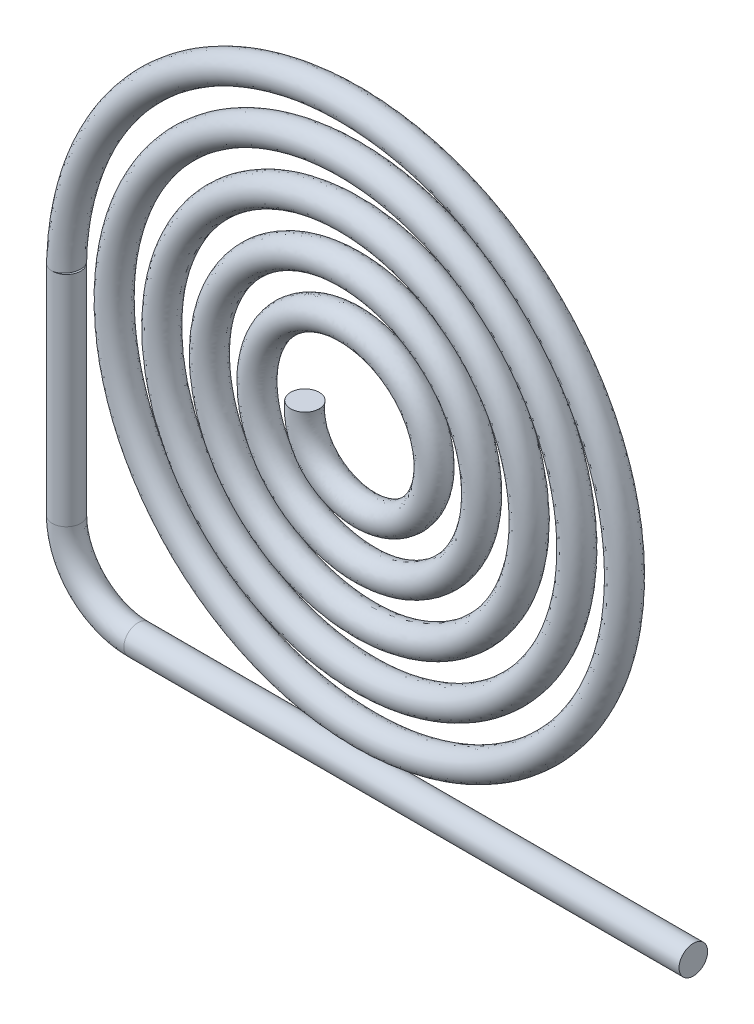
ISO-10303-21;
HEADER;
FILE_DESCRIPTION(('STEP AP214'),'2;1');
FILE_NAME('part.step','',(''),(''),'','','');
FILE_SCHEMA(('AUTOMOTIVE_DESIGN { 1 0 10303 214 1 1 1 1 }'));
ENDSEC;
DATA;
#1=APPLICATION_CONTEXT('core data for automotive mechanical design processes');
#2=APPLICATION_PROTOCOL_DEFINITION('international standard','automotive_design',2000,#1);
#3=PRODUCT_CONTEXT('',#1,'mechanical');
#4=PRODUCT('Part','Part','',(#3));
#5=PRODUCT_RELATED_PRODUCT_CATEGORY('part','',(#4));
#6=PRODUCT_DEFINITION_FORMATION('','',#4);
#7=PRODUCT_DEFINITION_CONTEXT('part definition',#1,'design');
#8=PRODUCT_DEFINITION('design','',#6,#7);
#9=PRODUCT_DEFINITION_SHAPE('','',#8);
#10=(LENGTH_UNIT() NAMED_UNIT(*) SI_UNIT(.MILLI.,.METRE.));
#11=(NAMED_UNIT(*) PLANE_ANGLE_UNIT() SI_UNIT($,.RADIAN.));
#12=(NAMED_UNIT(*) SI_UNIT($,.STERADIAN.) SOLID_ANGLE_UNIT());
#13=UNCERTAINTY_MEASURE_WITH_UNIT(LENGTH_MEASURE(1.E-05),#10,'distance_accuracy_value','');
#14=(GEOMETRIC_REPRESENTATION_CONTEXT(3) GLOBAL_UNCERTAINTY_ASSIGNED_CONTEXT((#13)) GLOBAL_UNIT_ASSIGNED_CONTEXT((#10,
#11,#12)) REPRESENTATION_CONTEXT('',''));
#15=CARTESIAN_POINT('',(0.,0.,0.));
#16=DIRECTION('',(0.,0.,1.));
#17=DIRECTION('',(1.,0.,0.));
#18=AXIS2_PLACEMENT_3D('',#15,#16,#17);
#19=CARTESIAN_POINT('',(-1.1,0.,-0.3));
#20=DIRECTION('',(0.,-1.,0.));
#21=DIRECTION('',(0.,0.,-1.));
#22=AXIS2_PLACEMENT_3D('',#19,#20,#21);
#23=PLANE('',#22);
#24=CARTESIAN_POINT('',(-1.1,0.,0.));
#25=DIRECTION('',(0.,1.,0.));
#26=DIRECTION('',(0.,0.,1.));
#27=AXIS2_PLACEMENT_3D('',#24,#25,#26);
#28=CIRCLE('',#27,0.3);
#29=CARTESIAN_POINT('',(-1.1,0.,0.3));
#30=VERTEX_POINT('',#29);
#31=EDGE_CURVE('E75',#30,#30,#28,.T.);
#32=ORIENTED_EDGE('',*,*,#31,.T.);
#33=EDGE_LOOP('',(#32));
#34=FACE_BOUND('',#33,.T.);
#35=ADVANCED_FACE('F43',(#34),#23,.F.);
#36=CARTESIAN_POINT('',(-6.1,0.,-0.3));
#37=DIRECTION('',(0.117333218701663,-0.993092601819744,0.));
#38=DIRECTION('',(0.993092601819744,0.117333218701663,0.));
#39=AXIS2_PLACEMENT_3D('',#36,#37,#38);
#40=PLANE('',#39);
#41=DIRECTION('',(0.,0.,1.));
#42=VECTOR('',#41,1.);
#43=CARTESIAN_POINT('',(-6.10000000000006,0.,-0.3));
#44=LINE('',#43,#42);
#45=CARTESIAN_POINT('',(-6.10000000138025,0.,-0.3));
#46=VERTEX_POINT('',#45);
#47=CARTESIAN_POINT('',(-6.10000000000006,0.,0.3));
#48=VERTEX_POINT('',#47);
#49=EDGE_CURVE('E72',#46,#48,#44,.T.);
#50=ORIENTED_EDGE('',*,*,#49,.F.);
#51=CARTESIAN_POINT('',(-6.1,0.,0.));
#52=DIRECTION('',(0.117333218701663,-0.993092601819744,0.));
#53=DIRECTION('',(0.,0.,1.));
#54=AXIS2_PLACEMENT_3D('',#51,#52,#53);
#55=CIRCLE('',#54,0.3);
#56=EDGE_CURVE('E52',#46,#48,#55,.T.);
#57=ORIENTED_EDGE('',*,*,#56,.T.);
#58=EDGE_LOOP('',(#50,#57));
#59=FACE_BOUND('',#58,.T.);
#60=ADVANCED_FACE('F45',(#59),#40,.T.);
#61=CARTESIAN_POINT('',(-1.1,0.,0.3));
#62=CARTESIAN_POINT('',(-1.12604221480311,-0.179987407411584,0.3));
#63=CARTESIAN_POINT('',(-1.10691809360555,-0.373080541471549,0.3));
#64=CARTESIAN_POINT('',(-0.971108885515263,-0.737648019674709,0.3));
#65=CARTESIAN_POINT('',(-0.85437839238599,-0.908681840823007,0.3));
#66=CARTESIAN_POINT('',(-0.541491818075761,-1.18038556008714,0.3));
#67=CARTESIAN_POINT('',(-0.345524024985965,-1.28063284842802,0.3));
#68=CARTESIAN_POINT('',(0.0839407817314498,-1.37526639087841,0.3));
#69=CARTESIAN_POINT('',(0.317048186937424,-1.3693662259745,0.3));
#70=CARTESIAN_POINT('',(0.764032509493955,-1.24059345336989,0.3));
#71=CARTESIAN_POINT('',(0.977408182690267,-1.11766120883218,0.3));
#72=CARTESIAN_POINT('',(1.32712923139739,-0.773623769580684,0.3));
#73=CARTESIAN_POINT('',(1.46298887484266,-0.552721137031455,0.3));
#74=CARTESIAN_POINT('',(1.61422494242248,-0.0593747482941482,0.3));
#75=CARTESIAN_POINT('',(1.6292636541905,0.212637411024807,0.3));
#76=CARTESIAN_POINT('',(1.52265857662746,0.743487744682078,0.3));
#77=CARTESIAN_POINT('',(1.40092746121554,1.00176266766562,0.3));
#78=CARTESIAN_POINT('',(1.03859093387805,1.43775572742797,0.3));
#79=CARTESIAN_POINT('',(0.798191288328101,1.61491863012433,0.3));
#80=CARTESIAN_POINT('',(0.248647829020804,1.83604745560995,0.3));
#81=CARTESIAN_POINT('',(-0.0600293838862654,1.87961356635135,0.3));
#82=CARTESIAN_POINT('',(-0.673997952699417,1.8105910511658,0.3));
#83=CARTESIAN_POINT('',(-0.97866533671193,1.69787451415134,0.3));
#84=CARTESIAN_POINT('',(-1.50736334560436,1.33136019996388,0.3));
#85=CARTESIAN_POINT('',(-1.73076445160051,1.07775924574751,0.3));
#86=CARTESIAN_POINT('',(-2.03404464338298,0.481675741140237,0.3));
#87=CARTESIAN_POINT('',(-2.11345193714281,0.139686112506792,0.3));
#88=CARTESIAN_POINT('',(-2.09742343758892,-0.554421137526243,0.3));
#89=CARTESIAN_POINT('',(-2.00180629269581,-0.905857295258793,0.3));
#90=CARTESIAN_POINT('',(-1.6462666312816,-1.53170710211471,0.3));
#91=CARTESIAN_POINT('',(-1.38651898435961,-1.80541391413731,0.3));
#92=CARTESIAN_POINT('',(-0.755389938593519,-2.20181583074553,0.3));
#93=CARTESIAN_POINT('',(-0.384517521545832,-2.32395844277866,0.3));
#94=CARTESIAN_POINT('',(0.38451752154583,-2.37604155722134,0.3));
#95=CARTESIAN_POINT('',(0.781946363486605,-2.30573471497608,0.3));
#96=CARTESIAN_POINT('',(1.50727403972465,-1.97709542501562,0.3));
#97=CARTESIAN_POINT('',(1.834387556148,-1.71890225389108,0.3));
#98=CARTESIAN_POINT('',(2.33335387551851,-1.06589353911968,0.3));
#99=CARTESIAN_POINT('',(2.50456613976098,-0.671591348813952,0.3));
#100=CARTESIAN_POINT('',(2.63929491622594,0.164965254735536,0.3));
#101=CARTESIAN_POINT('',(2.60248610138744,0.60644064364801,0.3));
#102=CARTESIAN_POINT('',(2.31717240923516,1.43134863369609,0.3));
#103=CARTESIAN_POINT('',(2.06875719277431,1.81391823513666,0.3));
#104=CARTESIAN_POINT('',(1.40851099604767,2.42314531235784,0.3));
#105=CARTESIAN_POINT('',(0.997184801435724,2.64906842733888,0.3));
#106=CARTESIAN_POINT('',(0.102636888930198,2.88010859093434,0.3));
#107=CARTESIAN_POINT('',(-0.379769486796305,2.88481115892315,0.3));
#108=CARTESIAN_POINT('',(-1.30206736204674,2.65946191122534,0.3));
#109=CARTESIAN_POINT('',(-1.74102099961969,2.42943599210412,0.3));
#110=CARTESIAN_POINT('',(-2.46626434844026,1.77784935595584,0.3));
#111=CARTESIAN_POINT('',(-2.75172184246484,1.35677086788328,0.3));
#112=CARTESIAN_POINT('',(-3.09159508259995,0.415779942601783,0.3));
#113=CARTESIAN_POINT('',(-3.14549708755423,-0.103291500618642,0.3));
#114=CARTESIAN_POINT('',(-2.99667073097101,-1.11846164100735,0.3));
#115=CARTESIAN_POINT('',(-2.79389049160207,-1.61355248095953,0.3));
#116=CARTESIAN_POINT('',(-2.16787035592,-2.45845941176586,0.3));
#117=CARTESIAN_POINT('',(-1.74507531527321,-2.80734328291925,0.3));
#118=CARTESIAN_POINT('',(-0.771068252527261,-3.26716464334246,0.3));
#119=CARTESIAN_POINT('',(-0.220710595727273,-3.37748032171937,0.3));
#120=CARTESIAN_POINT('',(0.880488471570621,-3.32135686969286,0.3));
#121=CARTESIAN_POINT('',(1.43025893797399,-3.1547744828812,0.3));
#122=CARTESIAN_POINT('',(2.39623104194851,-2.57197247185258,0.3));
#123=CARTESIAN_POINT('',(2.81140031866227,-2.15614492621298,0.3));
#124=CARTESIAN_POINT('',(3.40063258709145,-1.16425583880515,0.3));
#125=CARTESIAN_POINT('',(3.57395840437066,-0.58904829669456,0.3));
#126=CARTESIAN_POINT('',(3.62604159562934,0.589048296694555,0.3));
#127=CARTESIAN_POINT('',(3.5045514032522,1.19081222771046,0.3));
#128=CARTESIAN_POINT('',(2.9830818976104,2.27690001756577,0.3));
#129=CARTESIAN_POINT('',(2.58342615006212,2.76009333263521,0.3));
#130=CARTESIAN_POINT('',(1.59029522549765,3.48632212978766,0.3));
#131=CARTESIAN_POINT('',(0.997658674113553,3.72849949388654,0.3));
#132=CARTESIAN_POINT('',(-0.245989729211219,3.90332337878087,0.3));
#133=CARTESIAN_POINT('',(-0.895833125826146,3.8356060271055,0.3));
#134=CARTESIAN_POINT('',(-2.09866473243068,3.39375131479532,0.3));
#135=CARTESIAN_POINT('',(-2.65042832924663,3.01985320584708,0.3));
#136=CARTESIAN_POINT('',(-3.51916135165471,2.04339819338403,0.3));
#137=CARTESIAN_POINT('',(-3.83514802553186,1.44164847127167,0.3));
#138=CARTESIAN_POINT('',(-4.14599219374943,0.145899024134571,0.3));
#139=CARTESIAN_POINT('',(-4.14035870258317,-0.546901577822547,0.3));
#140=CARTESIAN_POINT('',(-3.79626520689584,-1.86064696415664,0.3));
#141=CARTESIAN_POINT('',(-3.45794454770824,-2.48027936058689,0.3));
#142=CARTESIAN_POINT('',(-2.51710775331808,-3.49477294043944,0.3));
#143=CARTESIAN_POINT('',(-1.91535045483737,-3.88852508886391,0.3));
#144=CARTESIAN_POINT('',(-0.58291204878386,-4.34714267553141,0.3));
#145=CARTESIAN_POINT('',(0.146553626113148,-4.41138063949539,0.3));
#146=CARTESIAN_POINT('',(1.56292532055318,-4.18275038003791,0.3));
#147=CARTESIAN_POINT('',(2.24843964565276,-3.88990649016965,0.3));
#148=CARTESIAN_POINT('',(3.40955545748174,-3.00438049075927,0.3));
#149=CARTESIAN_POINT('',(3.88392214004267,-2.41239139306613,0.3));
#150=CARTESIAN_POINT('',(4.50028461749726,-1.06046075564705,0.3));
#151=CARTESIAN_POINT('',(4.64150873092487,-0.301735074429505,0.3));
#152=CARTESIAN_POINT('',(4.54529027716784,1.20655580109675,0.3));
#153=CARTESIAN_POINT('',(4.30774269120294,1.9546605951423,0.3));
#154=CARTESIAN_POINT('',(3.49767829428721,3.26075496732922,0.3));
#155=CARTESIAN_POINT('',(2.92577087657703,3.81738674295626,0.3));
#156=CARTESIAN_POINT('',(1.57312173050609,4.59944932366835,0.3));
#157=CARTESIAN_POINT('',(0.793579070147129,4.82395838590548,0.3));
#158=CARTESIAN_POINT('',(-0.793579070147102,4.87604161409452,0.3));
#159=CARTESIAN_POINT('',(-1.59967810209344,4.70336810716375,0.3));
#160=CARTESIAN_POINT('',(-3.04652598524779,3.98906835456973,0.3));
#161=CARTESIAN_POINT('',(-3.68579912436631,3.44795005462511,0.3));
#162=CARTESIAN_POINT('',(-4.63929036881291,2.11469690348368,0.3));
#163=CARTESIAN_POINT('',(-4.95243286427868,1.32372599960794,0.3));
#164=CARTESIAN_POINT('',(-5.16735182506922,-0.327014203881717,0.3));
#165=CARTESIAN_POINT('',(-5.06872596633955,-1.1852256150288,0.3));
#166=CARTESIAN_POINT('',(-4.47033020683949,-2.76598082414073,0.3));
#167=CARTESIAN_POINT('',(-3.97094922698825,-3.48693843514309,0.3));
#168=CARTESIAN_POINT('',(-2.67828538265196,-4.61517737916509,0.3));
#169=CARTESIAN_POINT('',(-1.88611214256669,-5.02122763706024,0.3));
#170=CARTESIAN_POINT('',(-0.189161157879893,-5.41187578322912,0.3));
#171=CARTESIAN_POINT('',(0.714033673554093,-5.39590625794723,0.3));
#172=CARTESIAN_POINT('',(2.41922656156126,-4.9330684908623,0.3));
#173=CARTESIAN_POINT('',(3.21953773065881,-4.48645311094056,0.3));
#174=CARTESIAN_POINT('',(4.52328152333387,-3.25636614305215,0.3));
#175=CARTESIAN_POINT('',(5.02532834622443,-2.47393004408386,0.3));
#176=CARTESIAN_POINT('',(5.60269025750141,-0.750044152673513,0.3));
#177=CARTESIAN_POINT('',(5.67726420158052,0.189815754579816,0.3));
#178=CARTESIAN_POINT('',(5.36883001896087,2.00738899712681,0.3));
#179=CARTESIAN_POINT('',(4.9859224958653,2.88332681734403,0.3));
#180=CARTESIAN_POINT('',(3.84089061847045,4.3606514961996,0.3));
#181=CARTESIAN_POINT('',(3.07970747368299,4.96050100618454,0.3));
#182=CARTESIAN_POINT('',(1.34985325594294,5.7334045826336,0.3));
#183=CARTESIAN_POINT('',(0.382759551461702,5.90553714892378,0.3));
#184=CARTESIAN_POINT('',(-1.53262312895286,5.76922367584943,0.3));
#185=CARTESIAN_POINT('',(-2.47906225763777,5.46071090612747,0.3));
#186=CARTESIAN_POINT('',(-4.12527888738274,4.42338411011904,0.3));
#187=CARTESIAN_POINT('',(-4.82337317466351,3.69539683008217,0.3));
#188=CARTESIAN_POINT('',(-5.79826605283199,1.98198761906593,0.3));
#189=CARTESIAN_POINT('',(-6.07395833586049,0.998109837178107,0.3));
#190=CARTESIAN_POINT('',(-6.1,0.,0.3));
#191=CARTESIAN_POINT('',(-1.02152504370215,0.,0.3));
#192=CARTESIAN_POINT('',(-1.04757398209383,-0.166634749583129,0.3));
#193=CARTESIAN_POINT('',(-1.03166442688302,-0.347138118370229,0.3));
#194=CARTESIAN_POINT('',(-0.90864743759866,-0.688305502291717,0.3));
#195=CARTESIAN_POINT('',(-0.80074779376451,-0.849867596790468,0.3));
#196=CARTESIAN_POINT('',(-0.510245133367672,-1.10718040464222,0.3));
#197=CARTESIAN_POINT('',(-0.326539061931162,-1.20333931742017,0.3));
#198=CARTESIAN_POINT('',(0.076433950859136,-1.29603028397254,0.3));
#199=CARTESIAN_POINT('',(0.29683557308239,-1.29238809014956,0.3));
#200=CARTESIAN_POINT('',(0.719647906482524,-1.17453147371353,0.3));
#201=CARTESIAN_POINT('',(0.922945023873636,-1.05963110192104,0.3));
#202=CARTESIAN_POINT('',(1.25663778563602,-0.736682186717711,0.3));
#203=CARTESIAN_POINT('',(1.38746609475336,-0.527628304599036,0.3));
#204=CARTESIAN_POINT('',(1.53464965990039,-0.0604287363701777,0.3));
#205=CARTESIAN_POINT('',(1.5508991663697,0.198780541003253,0.3));
#206=CARTESIAN_POINT('',(1.45315604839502,0.704726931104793,0.3));
#207=CARTESIAN_POINT('',(1.33857025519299,0.952322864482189,0.3));
#208=CARTESIAN_POINT('',(0.995849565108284,1.37062982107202,0.3));
#209=CARTESIAN_POINT('',(0.766801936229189,1.54179428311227,0.3));
#210=CARTESIAN_POINT('',(0.242901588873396,1.75667844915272,0.3));
#211=CARTESIAN_POINT('',(-0.0529451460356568,1.80035416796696,0.3));
#212=CARTESIAN_POINT('',(-0.641395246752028,1.73800111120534,0.3));
#213=CARTESIAN_POINT('',(-0.934826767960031,1.63146501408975,0.3));
#214=CARTESIAN_POINT('',(-1.44423449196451,1.28291655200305,0.3));
#215=CARTESIAN_POINT('',(-1.66067796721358,1.04007965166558,0.3));
#216=CARTESIAN_POINT('',(-1.95549616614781,0.468947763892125,0.3));
#217=CARTESIAN_POINT('',(-2.03387989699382,0.139728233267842,0.3));
#218=CARTESIAN_POINT('',(-2.02222325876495,-0.528408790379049,0.3));
#219=CARTESIAN_POINT('',(-1.93175341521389,-0.868119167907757,0.3));
#220=CARTESIAN_POINT('',(-1.59236065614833,-1.47317748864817,0.3));
#221=CARTESIAN_POINT('',(-1.3426965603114,-1.73899824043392,0.3));
#222=CARTESIAN_POINT('',(-0.735626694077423,-2.1247388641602,0.3));
#223=CARTESIAN_POINT('',(-0.3773656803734,-2.24471082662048,0.3));
#224=CARTESIAN_POINT('',(0.365438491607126,-2.29879311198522,0.3));
#225=CARTESIAN_POINT('',(0.75073451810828,-2.23254283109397,0.3));
#226=CARTESIAN_POINT('',(1.45390828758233,-1.91807571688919,0.3));
#227=CARTESIAN_POINT('',(1.77225575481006,-1.66919533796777,0.3));
#228=CARTESIAN_POINT('',(2.25841493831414,-1.03914858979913,0.3));
#229=CARTESIAN_POINT('',(2.42631137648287,-0.657195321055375,0.3));
#230=CARTESIAN_POINT('',(2.56061983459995,0.153078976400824,0.3));
#231=CARTESIAN_POINT('',(2.52673034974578,0.58210872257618,0.3));
#232=CARTESIAN_POINT('',(2.25347473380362,1.38366655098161,0.3));
#233=CARTESIAN_POINT('',(2.01351595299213,1.75665296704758,0.3));
#234=CARTESIAN_POINT('',(1.3749320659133,2.35101099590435,0.3));
#235=CARTESIAN_POINT('',(0.97558632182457,2.5724894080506,0.3));
#236=CARTESIAN_POINT('',(0.107151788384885,2.8006702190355,0.3));
#237=CARTESIAN_POINT('',(-0.362598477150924,2.80711986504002,0.3));
#238=CARTESIAN_POINT('',(-1.2605376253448,2.59159394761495,0.3));
#239=CARTESIAN_POINT('',(-1.68916588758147,2.36908888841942,0.3));
#240=CARTESIAN_POINT('',(-2.39758912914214,1.73766927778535,0.3));
#241=CARTESIAN_POINT('',(-2.67750268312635,1.32809699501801,0.3));
#242=CARTESIAN_POINT('',(-3.01208447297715,0.41282419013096,0.3));
#243=CARTESIAN_POINT('',(-3.06653802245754,-0.0934887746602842,0.3));
#244=CARTESIAN_POINT('',(-2.92520008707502,-1.08349632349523,0.3));
#245=CARTESIAN_POINT('',(-2.72893361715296,-1.56760481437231,0.3));
#246=CARTESIAN_POINT('',(-2.12139991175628,-2.39387550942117,0.3));
#247=CARTESIAN_POINT('',(-1.70953319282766,-2.73615830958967,0.3));
#248=CARTESIAN_POINT('',(-0.760620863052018,-3.18828882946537,0.3));
#249=CARTESIAN_POINT('',(-0.223012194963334,-3.2979491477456,0.3));
#250=CARTESIAN_POINT('',(0.852438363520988,-3.24690087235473,0.3));
#251=CARTESIAN_POINT('',(1.39066343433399,-3.08576241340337,0.3));
#252=CARTESIAN_POINT('',(2.33633968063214,-2.51959410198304,0.3));
#253=CARTESIAN_POINT('',(2.74390452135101,-2.11401709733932,0.3));
#254=CARTESIAN_POINT('',(3.32310427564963,-1.14637297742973,0.3));
#255=CARTESIAN_POINT('',(3.49456843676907,-0.583791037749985,0.3));
#256=CARTESIAN_POINT('',(3.54925806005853,0.568198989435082,0.3));
#257=CARTESIAN_POINT('',(3.43208882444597,1.15795569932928,0.3));
#258=CARTESIAN_POINT('',(2.92524372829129,2.2222637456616,0.3));
#259=CARTESIAN_POINT('',(2.5350659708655,2.69691388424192,0.3));
#260=CARTESIAN_POINT('',(1.56510874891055,3.41085034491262,0.3));
#261=CARTESIAN_POINT('',(0.984860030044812,3.64997230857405,0.3));
#262=CARTESIAN_POINT('',(-0.232558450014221,3.82490192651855,0.3));
#263=CARTESIAN_POINT('',(-0.870039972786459,3.76033974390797,0.3));
#264=CARTESIAN_POINT('',(-2.04980061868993,3.33096120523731,0.3));
#265=CARTESIAN_POINT('',(-2.59215695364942,2.96568010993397,0.3));
#266=CARTESIAN_POINT('',(-3.44644278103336,2.01111373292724,0.3));
#267=CARTESIAN_POINT('',(-3.75820466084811,1.42140063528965,0.3));
#268=CARTESIAN_POINT('',(-4.06664588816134,0.151765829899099,0.3));
#269=CARTESIAN_POINT('',(-4.06296981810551,-0.528430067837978,0.3));
#270=CARTESIAN_POINT('',(-3.72908465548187,-1.81802057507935,0.3));
#271=CARTESIAN_POINT('',(-3.3984390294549,-2.42746543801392,0.3));
#272=CARTESIAN_POINT('',(-2.47800226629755,-3.42548385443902,0.3));
#273=CARTESIAN_POINT('',(-1.88781923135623,-3.81387771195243,0.3));
#274=CARTESIAN_POINT('',(-0.581140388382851,-4.26759985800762,0.3));
#275=CARTESIAN_POINT('',(0.135592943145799,-4.33257679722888,0.3));
#276=CARTESIAN_POINT('',(1.52694543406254,-4.11178821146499,0.3));
#277=CARTESIAN_POINT('',(2.20158400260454,-3.82560474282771,0.3));
#278=CARTESIAN_POINT('',(3.34434414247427,-2.95879924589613,0.3));
#279=CARTESIAN_POINT('',(3.81226612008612,-2.37781444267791,0.3));
#280=CARTESIAN_POINT('',(4.4212808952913,-1.05105001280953,0.3));
#281=CARTESIAN_POINT('',(4.56201637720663,-0.305067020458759,0.3));
#282=CARTESIAN_POINT('',(4.47119608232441,1.17756983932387,0.3));
#283=CARTESIAN_POINT('',(4.23923087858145,1.91420995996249,0.3));
#284=CARTESIAN_POINT('',(3.44603128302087,3.20023465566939,0.3));
#285=CARTESIAN_POINT('',(2.88445531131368,3.7493931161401,0.3));
#286=CARTESIAN_POINT('',(1.55614484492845,4.52171970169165,0.3));
#287=CARTESIAN_POINT('',(0.789237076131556,4.7445150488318,0.3));
#288=CARTESIAN_POINT('',(-0.771869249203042,4.79949894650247,0.3));
#289=CARTESIAN_POINT('',(-1.56602022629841,4.63127627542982,0.3));
#290=CARTESIAN_POINT('',(-2.99126828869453,3.93182613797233,0.3));
#291=CARTESIAN_POINT('',(-3.62210746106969,3.40026939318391,0.3));
#292=CARTESIAN_POINT('',(-4.56356154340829,2.09029981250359,0.3));
#293=CARTESIAN_POINT('',(-4.87377947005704,1.31173824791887,0.3));
#294=CARTESIAN_POINT('',(-5.08907117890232,-0.312794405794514,0.3));
#295=CARTESIAN_POINT('',(-4.99372162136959,-1.15868507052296,0.3));
#296=CARTESIAN_POINT('',(-4.40801922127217,-2.71650969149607,0.3));
#297=CARTESIAN_POINT('',(-3.91733973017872,-3.42815013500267,0.3));
#298=CARTESIAN_POINT('',(-2.64668573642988,-4.54216022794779,0.3));
#299=CARTESIAN_POINT('',(-1.86658013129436,-4.94410090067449,0.3));
#300=CARTESIAN_POINT('',(-0.195747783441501,-5.33258739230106,0.3));
#301=CARTESIAN_POINT('',(0.694868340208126,-5.31868764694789,0.3));
#302=CARTESIAN_POINT('',(2.37601278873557,-4.86626584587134,0.3));
#303=CARTESIAN_POINT('',(3.16620977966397,-4.42740952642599,0.3));
#304=CARTESIAN_POINT('',(4.45366383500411,-3.21785131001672,0.3));
#305=CARTESIAN_POINT('',(4.95045328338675,-2.44702777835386,0.3));
#306=CARTESIAN_POINT('',(5.52313676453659,-0.748926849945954,0.3));
#307=CARTESIAN_POINT('',(5.59855334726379,0.178214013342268,0.3));
#308=CARTESIAN_POINT('',(5.29815782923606,1.97084532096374,0.3));
#309=CARTESIAN_POINT('',(4.92199324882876,2.83596604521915,0.3));
#310=CARTESIAN_POINT('',(3.79581500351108,4.29509098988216,0.3));
#311=CARTESIAN_POINT('',(3.0456799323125,4.88858361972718,0.3));
#312=CARTESIAN_POINT('',(1.34103458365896,5.65433363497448,0.3));
#313=CARTESIAN_POINT('',(0.386680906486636,5.82607269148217,0.3));
#314=CARTESIAN_POINT('',(-1.50309993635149,5.69534297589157,0.3));
#315=CARTESIAN_POINT('',(-2.4381201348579,5.3924927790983,0.3));
#316=CARTESIAN_POINT('',(-4.06439657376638,4.3721658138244,0.3));
#317=CARTESIAN_POINT('',(-4.75509337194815,3.65455772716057,0.3));
#318=CARTESIAN_POINT('',(-5.72042288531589,1.96554362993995,0.3));
#319=CARTESIAN_POINT('',(-5.9944887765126,0.994313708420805,0.3));
#320=CARTESIAN_POINT('',(-6.02206710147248,0.00920771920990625,0.3));
#321=CARTESIAN_POINT('',(-0.8,0.,0.254858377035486));
#322=CARTESIAN_POINT('',(-0.826079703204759,-0.128953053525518,0.254858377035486));
#323=CARTESIAN_POINT('',(-0.819232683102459,-0.273905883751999,0.254858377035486));
#324=CARTESIAN_POINT('',(-0.73232653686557,-0.549017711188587,0.254858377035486));
#325=CARTESIAN_POINT('',(-0.649355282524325,-0.683842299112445,0.254858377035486));
#326=CARTESIAN_POINT('',(-0.422039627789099,-0.90053135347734,0.254858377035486));
#327=CARTESIAN_POINT('',(-0.272946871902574,-0.985149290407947,0.254858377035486));
#328=CARTESIAN_POINT('',(0.0552431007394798,-1.07235660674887,0.254858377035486));
#329=CARTESIAN_POINT('',(0.239777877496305,-1.07508838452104,0.254858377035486));
#330=CARTESIAN_POINT('',(0.594355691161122,-0.988046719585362,0.254858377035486));
#331=CARTESIAN_POINT('',(0.769202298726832,-0.895819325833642,0.254858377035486));
#332=CARTESIAN_POINT('',(1.05764919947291,-0.632400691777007,0.254858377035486));
#333=CARTESIAN_POINT('',(1.17427467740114,-0.456794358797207,0.254858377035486));
#334=CARTESIAN_POINT('',(1.3100185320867,-0.0634040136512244,0.254858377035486));
#335=CARTESIAN_POINT('',(1.32968596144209,0.159664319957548,0.254858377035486));
#336=CARTESIAN_POINT('',(1.25695905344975,0.595309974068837,0.254858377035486));
#337=CARTESIAN_POINT('',(1.16254361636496,0.81276044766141,0.254858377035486));
#338=CARTESIAN_POINT('',(0.875195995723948,1.18114173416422,0.254858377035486));
#339=CARTESIAN_POINT('',(0.678193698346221,1.33537334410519,0.254858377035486));
#340=CARTESIAN_POINT('',(0.226680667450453,1.53262961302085,0.254858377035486));
#341=CARTESIAN_POINT('',(-0.0329472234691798,1.57661474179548,0.254858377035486));
#342=CARTESIAN_POINT('',(-0.549361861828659,1.53308873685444,0.254858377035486));
#343=CARTESIAN_POINT('',(-0.811075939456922,1.44399925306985,0.254858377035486));
#344=CARTESIAN_POINT('',(-1.26602958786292,1.14616615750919,0.254858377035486));
#345=CARTESIAN_POINT('',(-1.46283253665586,0.933714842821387,0.254858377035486));
#346=CARTESIAN_POINT('',(-1.73376358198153,0.433018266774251,0.254858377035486));
#347=CARTESIAN_POINT('',(-1.80925792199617,0.1398471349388,0.254858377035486));
#348=CARTESIAN_POINT('',(-1.80994250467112,-0.454979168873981,0.254858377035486));
#349=CARTESIAN_POINT('',(-1.73400285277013,-0.761589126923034,0.254858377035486));
#350=CARTESIAN_POINT('',(-1.44019079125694,-1.30795566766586,0.254858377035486));
#351=CARTESIAN_POINT('',(-1.21899130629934,-1.55151505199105,0.254858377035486));
#352=CARTESIAN_POINT('',(-0.679837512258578,-1.907160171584,0.254858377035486));
#353=CARTESIAN_POINT('',(-0.357176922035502,-2.02100466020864,0.254858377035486));
#354=CARTESIAN_POINT('',(0.311580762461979,-2.08073035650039,0.254858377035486));
#355=CARTESIAN_POINT('',(0.662627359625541,-2.02593124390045,0.254858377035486));
#356=CARTESIAN_POINT('',(1.30326340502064,-1.75147041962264,0.254858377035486));
#357=CARTESIAN_POINT('',(1.59686540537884,-1.52887889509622,0.254858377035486));
#358=CARTESIAN_POINT('',(2.04687163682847,-0.963650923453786,0.254858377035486));
#359=CARTESIAN_POINT('',(2.20540791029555,-0.616557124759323,0.254858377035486));
#360=CARTESIAN_POINT('',(2.33852986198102,0.119525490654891,0.254858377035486));
#361=CARTESIAN_POINT('',(2.31288128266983,0.513422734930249,0.254858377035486));
#362=CARTESIAN_POINT('',(2.07366411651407,1.24906596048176,0.254858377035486));
#363=CARTESIAN_POINT('',(1.85757680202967,1.59500023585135,0.254858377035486));
#364=CARTESIAN_POINT('',(1.28014292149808,2.14738479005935,0.254858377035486));
#365=CARTESIAN_POINT('',(0.91461649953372,2.3563163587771,0.254858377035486));
#366=CARTESIAN_POINT('',(0.11989678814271,2.57642557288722,0.254858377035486));
#367=CARTESIAN_POINT('',(-0.314126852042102,2.58780700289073,0.254858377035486));
#368=CARTESIAN_POINT('',(-1.14330434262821,2.40001112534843,0.254858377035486));
#369=CARTESIAN_POINT('',(-1.5427853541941,2.19873651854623,0.254858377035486));
#370=CARTESIAN_POINT('',(-2.2037275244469,1.62424591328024,0.254858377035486));
#371=CARTESIAN_POINT('',(-2.46799122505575,1.24715421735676,0.254858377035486));
#372=CARTESIAN_POINT('',(-2.78763590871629,0.404480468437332,0.254858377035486));
#373=CARTESIAN_POINT('',(-2.84364639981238,-0.0658168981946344,0.254858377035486));
#374=CARTESIAN_POINT('',(-2.72344734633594,-0.984793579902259,0.254858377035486));
#375=CARTESIAN_POINT('',(-2.5455684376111,-1.43790026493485,0.254858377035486));
#376=CARTESIAN_POINT('',(-1.99021962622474,-2.21156318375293,0.254858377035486));
#377=CARTESIAN_POINT('',(-1.60920220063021,-2.53521198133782,0.254858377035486));
#378=CARTESIAN_POINT('',(-0.731129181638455,-2.96563221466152,0.254858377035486));
#379=CARTESIAN_POINT('',(-0.229509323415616,-3.07344253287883,0.254858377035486));
#380=CARTESIAN_POINT('',(0.773256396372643,-3.03672085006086,0.254858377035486));
#381=CARTESIAN_POINT('',(1.27889025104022,-2.89094992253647,0.254858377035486));
#382=CARTESIAN_POINT('',(2.16727381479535,-2.37173647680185,0.254858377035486));
#383=CARTESIAN_POINT('',(2.55337227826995,-1.99509547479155,0.254858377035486));
#384=CARTESIAN_POINT('',(3.10425149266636,-1.09589188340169,0.254858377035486));
#385=CARTESIAN_POINT('',(3.27046042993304,-0.568950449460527,0.254858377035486));
#386=CARTESIAN_POINT('',(3.33250768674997,0.509343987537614,0.254858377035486));
#387=CARTESIAN_POINT('',(3.22753597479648,1.06520580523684,0.254858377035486));
#388=CARTESIAN_POINT('',(2.7619737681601,2.06803234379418,0.254858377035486));
#389=CARTESIAN_POINT('',(2.3985511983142,2.51856615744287,0.254858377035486));
#390=CARTESIAN_POINT('',(1.49401045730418,3.19780288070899,0.254858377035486));
#391=CARTESIAN_POINT('',(0.948731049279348,3.42829982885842,0.254858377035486));
#392=CARTESIAN_POINT('',(-0.19464361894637,3.60352791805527,0.254858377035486));
#393=CARTESIAN_POINT('',(-0.797229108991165,3.54787238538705,0.254858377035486));
#394=CARTESIAN_POINT('',(-1.91186330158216,3.15371253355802,0.254858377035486));
#395=CARTESIAN_POINT('',(-2.42766410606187,2.81275619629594,0.254858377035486));
#396=CARTESIAN_POINT('',(-3.24116729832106,1.91997871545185,0.254858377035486));
#397=CARTESIAN_POINT('',(-3.5410031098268,1.36424351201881,0.254858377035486));
#398=CARTESIAN_POINT('',(-3.84266113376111,0.168327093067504,0.254858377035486));
#399=CARTESIAN_POINT('',(-3.84451062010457,-0.476287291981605,0.254858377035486));
#400=CARTESIAN_POINT('',(-3.53944231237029,-1.69769157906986,0.254858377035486));
#401=CARTESIAN_POINT('',(-3.23046235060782,-2.27837830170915,0.254858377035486));
#402=CARTESIAN_POINT('',(-2.36761233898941,-3.22988938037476,0.254858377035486));
#403=CARTESIAN_POINT('',(-1.81010201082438,-3.60315744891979,0.254858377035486));
#404=CARTESIAN_POINT('',(-0.576139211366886,-4.04306037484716,0.254858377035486));
#405=CARTESIAN_POINT('',(0.10465229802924,-4.11012334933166,0.254858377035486));
#406=CARTESIAN_POINT('',(1.42537868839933,-3.91147083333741,0.254858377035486));
#407=CARTESIAN_POINT('',(2.06931634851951,-3.64408890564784,0.254858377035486));
#408=CARTESIAN_POINT('',(3.16026070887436,-2.83012905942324,0.254858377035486));
#409=CARTESIAN_POINT('',(3.60999008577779,-2.28020801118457,0.254858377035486));
#410=CARTESIAN_POINT('',(4.19826321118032,-1.02448465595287,0.254858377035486));
#411=CARTESIAN_POINT('',(4.33761934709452,-0.314472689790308,0.254858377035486));
#412=CARTESIAN_POINT('',(4.26203738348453,1.09574607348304,0.254858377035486));
#413=CARTESIAN_POINT('',(4.04583055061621,1.80002284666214,0.254858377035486));
#414=CARTESIAN_POINT('',(3.30023819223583,3.02939334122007,0.254858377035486));
#415=CARTESIAN_POINT('',(2.76782660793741,3.55745556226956,0.254858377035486));
#416=CARTESIAN_POINT('',(1.50822120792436,4.30229864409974,0.254858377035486));
#417=CARTESIAN_POINT('',(0.776980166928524,4.52025638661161,0.254858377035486));
#418=CARTESIAN_POINT('',(-0.710585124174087,4.58342851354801,0.254858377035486));
#419=CARTESIAN_POINT('',(-1.4710082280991,4.4277699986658,0.254858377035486));
#420=CARTESIAN_POINT('',(-2.8352826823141,3.7702384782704,0.254858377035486));
#421=CARTESIAN_POINT('',(-3.44231381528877,3.26567281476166,0.254858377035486));
#422=CARTESIAN_POINT('',(-4.34978848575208,2.0214298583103,0.254858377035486));
#423=CARTESIAN_POINT('',(-4.65175071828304,1.27789831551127,0.254858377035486));
#424=CARTESIAN_POINT('',(-4.86809464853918,-0.272653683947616,0.254858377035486));
#425=CARTESIAN_POINT('',(-4.78199368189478,-1.08376441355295,0.254858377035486));
#426=CARTESIAN_POINT('',(-4.2321230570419,-2.57685883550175,0.254858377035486));
#427=CARTESIAN_POINT('',(-3.76600678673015,-3.26219807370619,0.254858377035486));
#428=CARTESIAN_POINT('',(-2.55748386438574,-4.3360418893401,0.254858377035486));
#429=CARTESIAN_POINT('',(-1.81144369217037,-4.72638171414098,0.254858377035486));
#430=CARTESIAN_POINT('',(-0.214341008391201,-5.10876612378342,0.254858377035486));
#431=CARTESIAN_POINT('',(0.640766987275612,-5.1007091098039,0.254858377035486));
#432=CARTESIAN_POINT('',(2.25402568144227,-4.67769028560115,0.254858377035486));
#433=CARTESIAN_POINT('',(3.01567160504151,-4.2607368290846,0.254858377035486));
#434=CARTESIAN_POINT('',(4.2571417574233,-3.10912872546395,0.254858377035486));
#435=CARTESIAN_POINT('',(4.73909029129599,-2.37108602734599,0.254858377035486));
#436=CARTESIAN_POINT('',(5.29856714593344,-0.745772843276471,0.254858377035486));
#437=CARTESIAN_POINT('',(5.37636239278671,0.145463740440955,0.254858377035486));
#438=CARTESIAN_POINT('',(5.09865902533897,1.86768706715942,0.254858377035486));
#439=CARTESIAN_POINT('',(4.74152893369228,2.70227247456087,0.254858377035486));
#440=CARTESIAN_POINT('',(3.66857214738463,4.11002183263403,0.254858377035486));
#441=CARTESIAN_POINT('',(2.94962441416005,4.68556978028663,0.254858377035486));
#442=CARTESIAN_POINT('',(1.31614056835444,5.43112618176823,0.254858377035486));
#443=CARTESIAN_POINT('',(0.397750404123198,5.60175440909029,0.254858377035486));
#444=CARTESIAN_POINT('',(-1.41975963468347,5.48678694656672,0.254858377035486));
#445=CARTESIAN_POINT('',(-2.3225456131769,5.19992148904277,0.254858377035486));
#446=CARTESIAN_POINT('',(-3.89253337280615,4.22758293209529,0.254858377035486));
#447=CARTESIAN_POINT('',(-4.56234797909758,3.53927401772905,0.254858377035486));
#448=CARTESIAN_POINT('',(-5.50068130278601,1.91912429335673,0.254858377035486));
#449=CARTESIAN_POINT('',(-5.77015610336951,0.983595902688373,0.254858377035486));
#450=CARTESIAN_POINT('',(-5.80207221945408,0.0351999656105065,0.254858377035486));
#451=CARTESIAN_POINT('',(-0.8,0.,-0.254858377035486));
#452=CARTESIAN_POINT('',(-0.826079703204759,-0.128953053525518,-0.254858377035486));
#453=CARTESIAN_POINT('',(-0.819232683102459,-0.273905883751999,-0.254858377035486));
#454=CARTESIAN_POINT('',(-0.73232653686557,-0.549017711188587,-0.254858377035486));
#455=CARTESIAN_POINT('',(-0.649355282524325,-0.683842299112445,-0.254858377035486));
#456=CARTESIAN_POINT('',(-0.422039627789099,-0.90053135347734,-0.254858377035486));
#457=CARTESIAN_POINT('',(-0.272946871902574,-0.985149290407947,-0.254858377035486));
#458=CARTESIAN_POINT('',(0.0552431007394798,-1.07235660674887,-0.254858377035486));
#459=CARTESIAN_POINT('',(0.239777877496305,-1.07508838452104,-0.254858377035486));
#460=CARTESIAN_POINT('',(0.594355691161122,-0.988046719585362,-0.254858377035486));
#461=CARTESIAN_POINT('',(0.769202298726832,-0.895819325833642,-0.254858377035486));
#462=CARTESIAN_POINT('',(1.05764919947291,-0.632400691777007,-0.254858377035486));
#463=CARTESIAN_POINT('',(1.17427467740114,-0.456794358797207,-0.254858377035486));
#464=CARTESIAN_POINT('',(1.3100185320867,-0.0634040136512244,-0.254858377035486));
#465=CARTESIAN_POINT('',(1.32968596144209,0.159664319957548,-0.254858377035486));
#466=CARTESIAN_POINT('',(1.25695905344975,0.595309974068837,-0.254858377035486));
#467=CARTESIAN_POINT('',(1.16254361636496,0.81276044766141,-0.254858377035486));
#468=CARTESIAN_POINT('',(0.875195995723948,1.18114173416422,-0.254858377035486));
#469=CARTESIAN_POINT('',(0.678193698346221,1.33537334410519,-0.254858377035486));
#470=CARTESIAN_POINT('',(0.226680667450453,1.53262961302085,-0.254858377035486));
#471=CARTESIAN_POINT('',(-0.0329472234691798,1.57661474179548,-0.254858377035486));
#472=CARTESIAN_POINT('',(-0.549361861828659,1.53308873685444,-0.254858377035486));
#473=CARTESIAN_POINT('',(-0.811075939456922,1.44399925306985,-0.254858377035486));
#474=CARTESIAN_POINT('',(-1.26602958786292,1.14616615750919,-0.254858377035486));
#475=CARTESIAN_POINT('',(-1.46283253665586,0.933714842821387,-0.254858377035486));
#476=CARTESIAN_POINT('',(-1.73376358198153,0.433018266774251,-0.254858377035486));
#477=CARTESIAN_POINT('',(-1.80925792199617,0.1398471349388,-0.254858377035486));
#478=CARTESIAN_POINT('',(-1.80994250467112,-0.454979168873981,-0.254858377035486));
#479=CARTESIAN_POINT('',(-1.73400285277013,-0.761589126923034,-0.254858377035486));
#480=CARTESIAN_POINT('',(-1.44019079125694,-1.30795566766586,-0.254858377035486));
#481=CARTESIAN_POINT('',(-1.21899130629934,-1.55151505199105,-0.254858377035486));
#482=CARTESIAN_POINT('',(-0.679837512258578,-1.907160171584,-0.254858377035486));
#483=CARTESIAN_POINT('',(-0.357176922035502,-2.02100466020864,-0.254858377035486));
#484=CARTESIAN_POINT('',(0.311580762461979,-2.08073035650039,-0.254858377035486));
#485=CARTESIAN_POINT('',(0.662627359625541,-2.02593124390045,-0.254858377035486));
#486=CARTESIAN_POINT('',(1.30326340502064,-1.75147041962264,-0.254858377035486));
#487=CARTESIAN_POINT('',(1.59686540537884,-1.52887889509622,-0.254858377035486));
#488=CARTESIAN_POINT('',(2.04687163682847,-0.963650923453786,-0.254858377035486));
#489=CARTESIAN_POINT('',(2.20540791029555,-0.616557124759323,-0.254858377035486));
#490=CARTESIAN_POINT('',(2.33852986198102,0.119525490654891,-0.254858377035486));
#491=CARTESIAN_POINT('',(2.31288128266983,0.513422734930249,-0.254858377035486));
#492=CARTESIAN_POINT('',(2.07366411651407,1.24906596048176,-0.254858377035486));
#493=CARTESIAN_POINT('',(1.85757680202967,1.59500023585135,-0.254858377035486));
#494=CARTESIAN_POINT('',(1.28014292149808,2.14738479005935,-0.254858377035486));
#495=CARTESIAN_POINT('',(0.91461649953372,2.3563163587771,-0.254858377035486));
#496=CARTESIAN_POINT('',(0.11989678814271,2.57642557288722,-0.254858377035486));
#497=CARTESIAN_POINT('',(-0.314126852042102,2.58780700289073,-0.254858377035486));
#498=CARTESIAN_POINT('',(-1.14330434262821,2.40001112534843,-0.254858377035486));
#499=CARTESIAN_POINT('',(-1.5427853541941,2.19873651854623,-0.254858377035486));
#500=CARTESIAN_POINT('',(-2.2037275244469,1.62424591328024,-0.254858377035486));
#501=CARTESIAN_POINT('',(-2.46799122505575,1.24715421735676,-0.254858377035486));
#502=CARTESIAN_POINT('',(-2.78763590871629,0.404480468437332,-0.254858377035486));
#503=CARTESIAN_POINT('',(-2.84364639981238,-0.0658168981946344,-0.254858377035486));
#504=CARTESIAN_POINT('',(-2.72344734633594,-0.984793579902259,-0.254858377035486));
#505=CARTESIAN_POINT('',(-2.5455684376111,-1.43790026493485,-0.254858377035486));
#506=CARTESIAN_POINT('',(-1.99021962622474,-2.21156318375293,-0.254858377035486));
#507=CARTESIAN_POINT('',(-1.60920220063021,-2.53521198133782,-0.254858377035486));
#508=CARTESIAN_POINT('',(-0.731129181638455,-2.96563221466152,-0.254858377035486));
#509=CARTESIAN_POINT('',(-0.229509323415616,-3.07344253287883,-0.254858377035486));
#510=CARTESIAN_POINT('',(0.773256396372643,-3.03672085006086,-0.254858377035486));
#511=CARTESIAN_POINT('',(1.27889025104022,-2.89094992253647,-0.254858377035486));
#512=CARTESIAN_POINT('',(2.16727381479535,-2.37173647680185,-0.254858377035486));
#513=CARTESIAN_POINT('',(2.55337227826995,-1.99509547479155,-0.254858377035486));
#514=CARTESIAN_POINT('',(3.10425149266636,-1.09589188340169,-0.254858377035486));
#515=CARTESIAN_POINT('',(3.27046042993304,-0.568950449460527,-0.254858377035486));
#516=CARTESIAN_POINT('',(3.33250768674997,0.509343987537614,-0.254858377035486));
#517=CARTESIAN_POINT('',(3.22753597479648,1.06520580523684,-0.254858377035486));
#518=CARTESIAN_POINT('',(2.7619737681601,2.06803234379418,-0.254858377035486));
#519=CARTESIAN_POINT('',(2.3985511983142,2.51856615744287,-0.254858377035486));
#520=CARTESIAN_POINT('',(1.49401045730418,3.19780288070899,-0.254858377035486));
#521=CARTESIAN_POINT('',(0.948731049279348,3.42829982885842,-0.254858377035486));
#522=CARTESIAN_POINT('',(-0.19464361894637,3.60352791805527,-0.254858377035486));
#523=CARTESIAN_POINT('',(-0.797229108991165,3.54787238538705,-0.254858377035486));
#524=CARTESIAN_POINT('',(-1.91186330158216,3.15371253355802,-0.254858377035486));
#525=CARTESIAN_POINT('',(-2.42766410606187,2.81275619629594,-0.254858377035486));
#526=CARTESIAN_POINT('',(-3.24116729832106,1.91997871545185,-0.254858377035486));
#527=CARTESIAN_POINT('',(-3.5410031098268,1.36424351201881,-0.254858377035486));
#528=CARTESIAN_POINT('',(-3.84266113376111,0.168327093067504,-0.254858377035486));
#529=CARTESIAN_POINT('',(-3.84451062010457,-0.476287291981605,-0.254858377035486));
#530=CARTESIAN_POINT('',(-3.53944231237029,-1.69769157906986,-0.254858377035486));
#531=CARTESIAN_POINT('',(-3.23046235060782,-2.27837830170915,-0.254858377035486));
#532=CARTESIAN_POINT('',(-2.36761233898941,-3.22988938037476,-0.254858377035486));
#533=CARTESIAN_POINT('',(-1.81010201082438,-3.60315744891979,-0.254858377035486));
#534=CARTESIAN_POINT('',(-0.576139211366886,-4.04306037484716,-0.254858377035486));
#535=CARTESIAN_POINT('',(0.10465229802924,-4.11012334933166,-0.254858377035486));
#536=CARTESIAN_POINT('',(1.42537868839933,-3.91147083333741,-0.254858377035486));
#537=CARTESIAN_POINT('',(2.06931634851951,-3.64408890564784,-0.254858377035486));
#538=CARTESIAN_POINT('',(3.16026070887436,-2.83012905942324,-0.254858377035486));
#539=CARTESIAN_POINT('',(3.60999008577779,-2.28020801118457,-0.254858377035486));
#540=CARTESIAN_POINT('',(4.19826321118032,-1.02448465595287,-0.254858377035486));
#541=CARTESIAN_POINT('',(4.33761934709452,-0.314472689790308,-0.254858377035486));
#542=CARTESIAN_POINT('',(4.26203738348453,1.09574607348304,-0.254858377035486));
#543=CARTESIAN_POINT('',(4.04583055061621,1.80002284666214,-0.254858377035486));
#544=CARTESIAN_POINT('',(3.30023819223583,3.02939334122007,-0.254858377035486));
#545=CARTESIAN_POINT('',(2.76782660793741,3.55745556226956,-0.254858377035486));
#546=CARTESIAN_POINT('',(1.50822120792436,4.30229864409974,-0.254858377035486));
#547=CARTESIAN_POINT('',(0.776980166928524,4.52025638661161,-0.254858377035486));
#548=CARTESIAN_POINT('',(-0.710585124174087,4.58342851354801,-0.254858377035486));
#549=CARTESIAN_POINT('',(-1.4710082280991,4.4277699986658,-0.254858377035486));
#550=CARTESIAN_POINT('',(-2.8352826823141,3.7702384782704,-0.254858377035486));
#551=CARTESIAN_POINT('',(-3.44231381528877,3.26567281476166,-0.254858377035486));
#552=CARTESIAN_POINT('',(-4.34978848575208,2.0214298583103,-0.254858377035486));
#553=CARTESIAN_POINT('',(-4.65175071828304,1.27789831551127,-0.254858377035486));
#554=CARTESIAN_POINT('',(-4.86809464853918,-0.272653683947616,-0.254858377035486));
#555=CARTESIAN_POINT('',(-4.78199368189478,-1.08376441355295,-0.254858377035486));
#556=CARTESIAN_POINT('',(-4.2321230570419,-2.57685883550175,-0.254858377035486));
#557=CARTESIAN_POINT('',(-3.76600678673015,-3.26219807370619,-0.254858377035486));
#558=CARTESIAN_POINT('',(-2.55748386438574,-4.3360418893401,-0.254858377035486));
#559=CARTESIAN_POINT('',(-1.81144369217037,-4.72638171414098,-0.254858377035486));
#560=CARTESIAN_POINT('',(-0.214341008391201,-5.10876612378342,-0.254858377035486));
#561=CARTESIAN_POINT('',(0.640766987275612,-5.1007091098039,-0.254858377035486));
#562=CARTESIAN_POINT('',(2.25402568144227,-4.67769028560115,-0.254858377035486));
#563=CARTESIAN_POINT('',(3.01567160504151,-4.2607368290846,-0.254858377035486));
#564=CARTESIAN_POINT('',(4.2571417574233,-3.10912872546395,-0.254858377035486));
#565=CARTESIAN_POINT('',(4.73909029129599,-2.37108602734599,-0.254858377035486));
#566=CARTESIAN_POINT('',(5.29856714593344,-0.745772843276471,-0.254858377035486));
#567=CARTESIAN_POINT('',(5.37636239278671,0.145463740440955,-0.254858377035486));
#568=CARTESIAN_POINT('',(5.09865902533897,1.86768706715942,-0.254858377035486));
#569=CARTESIAN_POINT('',(4.74152893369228,2.70227247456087,-0.254858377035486));
#570=CARTESIAN_POINT('',(3.66857214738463,4.11002183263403,-0.254858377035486));
#571=CARTESIAN_POINT('',(2.94962441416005,4.68556978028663,-0.254858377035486));
#572=CARTESIAN_POINT('',(1.31614056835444,5.43112618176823,-0.254858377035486));
#573=CARTESIAN_POINT('',(0.397750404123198,5.60175440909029,-0.254858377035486));
#574=CARTESIAN_POINT('',(-1.41975963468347,5.48678694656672,-0.254858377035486));
#575=CARTESIAN_POINT('',(-2.3225456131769,5.19992148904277,-0.254858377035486));
#576=CARTESIAN_POINT('',(-3.89253337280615,4.22758293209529,-0.254858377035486));
#577=CARTESIAN_POINT('',(-4.56234797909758,3.53927401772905,-0.254858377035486));
#578=CARTESIAN_POINT('',(-5.50068130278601,1.91912429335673,-0.254858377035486));
#579=CARTESIAN_POINT('',(-5.77015610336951,0.983595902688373,-0.254858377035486));
#580=CARTESIAN_POINT('',(-5.80207221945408,0.0351999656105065,-0.254858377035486));
#581=CARTESIAN_POINT('',(-1.02152504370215,0.,-0.3));
#582=CARTESIAN_POINT('',(-1.04757398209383,-0.166634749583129,-0.3));
#583=CARTESIAN_POINT('',(-1.03166442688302,-0.347138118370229,-0.3));
#584=CARTESIAN_POINT('',(-0.90864743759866,-0.688305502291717,-0.3));
#585=CARTESIAN_POINT('',(-0.80074779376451,-0.849867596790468,-0.3));
#586=CARTESIAN_POINT('',(-0.510245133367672,-1.10718040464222,-0.3));
#587=CARTESIAN_POINT('',(-0.326539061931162,-1.20333931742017,-0.3));
#588=CARTESIAN_POINT('',(0.076433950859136,-1.29603028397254,-0.3));
#589=CARTESIAN_POINT('',(0.29683557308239,-1.29238809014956,-0.3));
#590=CARTESIAN_POINT('',(0.719647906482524,-1.17453147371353,-0.3));
#591=CARTESIAN_POINT('',(0.922945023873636,-1.05963110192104,-0.3));
#592=CARTESIAN_POINT('',(1.25663778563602,-0.736682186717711,-0.3));
#593=CARTESIAN_POINT('',(1.38746609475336,-0.527628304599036,-0.3));
#594=CARTESIAN_POINT('',(1.53464965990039,-0.0604287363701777,-0.3));
#595=CARTESIAN_POINT('',(1.5508991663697,0.198780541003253,-0.3));
#596=CARTESIAN_POINT('',(1.45315604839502,0.704726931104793,-0.3));
#597=CARTESIAN_POINT('',(1.33857025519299,0.952322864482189,-0.3));
#598=CARTESIAN_POINT('',(0.995849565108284,1.37062982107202,-0.3));
#599=CARTESIAN_POINT('',(0.766801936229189,1.54179428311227,-0.3));
#600=CARTESIAN_POINT('',(0.242901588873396,1.75667844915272,-0.3));
#601=CARTESIAN_POINT('',(-0.0529451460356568,1.80035416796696,-0.3));
#602=CARTESIAN_POINT('',(-0.641395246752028,1.73800111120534,-0.3));
#603=CARTESIAN_POINT('',(-0.934826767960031,1.63146501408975,-0.3));
#604=CARTESIAN_POINT('',(-1.44423449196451,1.28291655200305,-0.3));
#605=CARTESIAN_POINT('',(-1.66067796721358,1.04007965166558,-0.3));
#606=CARTESIAN_POINT('',(-1.95549616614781,0.468947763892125,-0.3));
#607=CARTESIAN_POINT('',(-2.03387989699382,0.139728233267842,-0.3));
#608=CARTESIAN_POINT('',(-2.02222325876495,-0.528408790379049,-0.3));
#609=CARTESIAN_POINT('',(-1.93175341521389,-0.868119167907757,-0.3));
#610=CARTESIAN_POINT('',(-1.59236065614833,-1.47317748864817,-0.3));
#611=CARTESIAN_POINT('',(-1.3426965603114,-1.73899824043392,-0.3));
#612=CARTESIAN_POINT('',(-0.735626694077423,-2.1247388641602,-0.3));
#613=CARTESIAN_POINT('',(-0.3773656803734,-2.24471082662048,-0.3));
#614=CARTESIAN_POINT('',(0.365438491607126,-2.29879311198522,-0.3));
#615=CARTESIAN_POINT('',(0.75073451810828,-2.23254283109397,-0.3));
#616=CARTESIAN_POINT('',(1.45390828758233,-1.91807571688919,-0.3));
#617=CARTESIAN_POINT('',(1.77225575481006,-1.66919533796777,-0.3));
#618=CARTESIAN_POINT('',(2.25841493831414,-1.03914858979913,-0.3));
#619=CARTESIAN_POINT('',(2.42631137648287,-0.657195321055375,-0.3));
#620=CARTESIAN_POINT('',(2.56061983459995,0.153078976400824,-0.3));
#621=CARTESIAN_POINT('',(2.52673034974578,0.58210872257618,-0.3));
#622=CARTESIAN_POINT('',(2.25347473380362,1.38366655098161,-0.3));
#623=CARTESIAN_POINT('',(2.01351595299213,1.75665296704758,-0.3));
#624=CARTESIAN_POINT('',(1.3749320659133,2.35101099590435,-0.3));
#625=CARTESIAN_POINT('',(0.97558632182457,2.5724894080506,-0.3));
#626=CARTESIAN_POINT('',(0.107151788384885,2.8006702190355,-0.3));
#627=CARTESIAN_POINT('',(-0.362598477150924,2.80711986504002,-0.3));
#628=CARTESIAN_POINT('',(-1.2605376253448,2.59159394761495,-0.3));
#629=CARTESIAN_POINT('',(-1.68916588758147,2.36908888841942,-0.3));
#630=CARTESIAN_POINT('',(-2.39758912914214,1.73766927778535,-0.3));
#631=CARTESIAN_POINT('',(-2.67750268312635,1.32809699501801,-0.3));
#632=CARTESIAN_POINT('',(-3.01208447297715,0.41282419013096,-0.3));
#633=CARTESIAN_POINT('',(-3.06653802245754,-0.0934887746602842,-0.3));
#634=CARTESIAN_POINT('',(-2.92520008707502,-1.08349632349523,-0.3));
#635=CARTESIAN_POINT('',(-2.72893361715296,-1.56760481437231,-0.3));
#636=CARTESIAN_POINT('',(-2.12139991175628,-2.39387550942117,-0.3));
#637=CARTESIAN_POINT('',(-1.70953319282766,-2.73615830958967,-0.3));
#638=CARTESIAN_POINT('',(-0.760620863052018,-3.18828882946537,-0.3));
#639=CARTESIAN_POINT('',(-0.223012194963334,-3.2979491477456,-0.3));
#640=CARTESIAN_POINT('',(0.852438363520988,-3.24690087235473,-0.3));
#641=CARTESIAN_POINT('',(1.39066343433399,-3.08576241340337,-0.3));
#642=CARTESIAN_POINT('',(2.33633968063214,-2.51959410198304,-0.3));
#643=CARTESIAN_POINT('',(2.74390452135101,-2.11401709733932,-0.3));
#644=CARTESIAN_POINT('',(3.32310427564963,-1.14637297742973,-0.3));
#645=CARTESIAN_POINT('',(3.49456843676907,-0.583791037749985,-0.3));
#646=CARTESIAN_POINT('',(3.54925806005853,0.568198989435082,-0.3));
#647=CARTESIAN_POINT('',(3.43208882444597,1.15795569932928,-0.3));
#648=CARTESIAN_POINT('',(2.92524372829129,2.2222637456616,-0.3));
#649=CARTESIAN_POINT('',(2.5350659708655,2.69691388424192,-0.3));
#650=CARTESIAN_POINT('',(1.56510874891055,3.41085034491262,-0.3));
#651=CARTESIAN_POINT('',(0.984860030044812,3.64997230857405,-0.3));
#652=CARTESIAN_POINT('',(-0.232558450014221,3.82490192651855,-0.3));
#653=CARTESIAN_POINT('',(-0.870039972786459,3.76033974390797,-0.3));
#654=CARTESIAN_POINT('',(-2.04980061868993,3.33096120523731,-0.3));
#655=CARTESIAN_POINT('',(-2.59215695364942,2.96568010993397,-0.3));
#656=CARTESIAN_POINT('',(-3.44644278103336,2.01111373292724,-0.3));
#657=CARTESIAN_POINT('',(-3.75820466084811,1.42140063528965,-0.3));
#658=CARTESIAN_POINT('',(-4.06664588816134,0.151765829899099,-0.3));
#659=CARTESIAN_POINT('',(-4.06296981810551,-0.528430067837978,-0.3));
#660=CARTESIAN_POINT('',(-3.72908465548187,-1.81802057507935,-0.3));
#661=CARTESIAN_POINT('',(-3.3984390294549,-2.42746543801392,-0.3));
#662=CARTESIAN_POINT('',(-2.47800226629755,-3.42548385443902,-0.3));
#663=CARTESIAN_POINT('',(-1.88781923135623,-3.81387771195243,-0.3));
#664=CARTESIAN_POINT('',(-0.581140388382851,-4.26759985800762,-0.3));
#665=CARTESIAN_POINT('',(0.135592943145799,-4.33257679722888,-0.3));
#666=CARTESIAN_POINT('',(1.52694543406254,-4.11178821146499,-0.3));
#667=CARTESIAN_POINT('',(2.20158400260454,-3.82560474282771,-0.3));
#668=CARTESIAN_POINT('',(3.34434414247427,-2.95879924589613,-0.3));
#669=CARTESIAN_POINT('',(3.81226612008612,-2.37781444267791,-0.3));
#670=CARTESIAN_POINT('',(4.4212808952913,-1.05105001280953,-0.3));
#671=CARTESIAN_POINT('',(4.56201637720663,-0.305067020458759,-0.3));
#672=CARTESIAN_POINT('',(4.47119608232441,1.17756983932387,-0.3));
#673=CARTESIAN_POINT('',(4.23923087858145,1.91420995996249,-0.3));
#674=CARTESIAN_POINT('',(3.44603128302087,3.20023465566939,-0.3));
#675=CARTESIAN_POINT('',(2.88445531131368,3.7493931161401,-0.3));
#676=CARTESIAN_POINT('',(1.55614484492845,4.52171970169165,-0.3));
#677=CARTESIAN_POINT('',(0.789237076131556,4.7445150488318,-0.3));
#678=CARTESIAN_POINT('',(-0.771869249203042,4.79949894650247,-0.3));
#679=CARTESIAN_POINT('',(-1.56602022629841,4.63127627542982,-0.3));
#680=CARTESIAN_POINT('',(-2.99126828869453,3.93182613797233,-0.3));
#681=CARTESIAN_POINT('',(-3.62210746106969,3.40026939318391,-0.3));
#682=CARTESIAN_POINT('',(-4.56356154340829,2.09029981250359,-0.3));
#683=CARTESIAN_POINT('',(-4.87377947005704,1.31173824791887,-0.3));
#684=CARTESIAN_POINT('',(-5.08907117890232,-0.312794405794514,-0.3));
#685=CARTESIAN_POINT('',(-4.99372162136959,-1.15868507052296,-0.3));
#686=CARTESIAN_POINT('',(-4.40801922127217,-2.71650969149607,-0.3));
#687=CARTESIAN_POINT('',(-3.91733973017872,-3.42815013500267,-0.3));
#688=CARTESIAN_POINT('',(-2.64668573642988,-4.54216022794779,-0.3));
#689=CARTESIAN_POINT('',(-1.86658013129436,-4.94410090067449,-0.3));
#690=CARTESIAN_POINT('',(-0.195747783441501,-5.33258739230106,-0.3));
#691=CARTESIAN_POINT('',(0.694868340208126,-5.31868764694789,-0.3));
#692=CARTESIAN_POINT('',(2.37601278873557,-4.86626584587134,-0.3));
#693=CARTESIAN_POINT('',(3.16620977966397,-4.42740952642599,-0.3));
#694=CARTESIAN_POINT('',(4.45366383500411,-3.21785131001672,-0.3));
#695=CARTESIAN_POINT('',(4.95045328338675,-2.44702777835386,-0.3));
#696=CARTESIAN_POINT('',(5.52313676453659,-0.748926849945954,-0.3));
#697=CARTESIAN_POINT('',(5.59855334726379,0.178214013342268,-0.3));
#698=CARTESIAN_POINT('',(5.29815782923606,1.97084532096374,-0.3));
#699=CARTESIAN_POINT('',(4.92199324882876,2.83596604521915,-0.3));
#700=CARTESIAN_POINT('',(3.79581500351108,4.29509098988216,-0.3));
#701=CARTESIAN_POINT('',(3.0456799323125,4.88858361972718,-0.3));
#702=CARTESIAN_POINT('',(1.34103458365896,5.65433363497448,-0.3));
#703=CARTESIAN_POINT('',(0.386680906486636,5.82607269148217,-0.3));
#704=CARTESIAN_POINT('',(-1.50309993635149,5.69534297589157,-0.3));
#705=CARTESIAN_POINT('',(-2.4381201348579,5.3924927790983,-0.3));
#706=CARTESIAN_POINT('',(-4.06439657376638,4.3721658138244,-0.3));
#707=CARTESIAN_POINT('',(-4.75509337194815,3.65455772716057,-0.3));
#708=CARTESIAN_POINT('',(-5.72042288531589,1.96554362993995,-0.3));
#709=CARTESIAN_POINT('',(-5.9944887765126,0.994313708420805,-0.3));
#710=CARTESIAN_POINT('',(-6.02206710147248,0.00920771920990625,-0.3));
#711=CARTESIAN_POINT('',(-1.17847495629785,0.,-0.3));
#712=CARTESIAN_POINT('',(-1.20451044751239,-0.193340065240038,-0.3));
#713=CARTESIAN_POINT('',(-1.18217176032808,-0.399022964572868,-0.3));
#714=CARTESIAN_POINT('',(-1.03357033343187,-0.786990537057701,-0.3));
#715=CARTESIAN_POINT('',(-0.908008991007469,-0.967496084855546,-0.3));
#716=CARTESIAN_POINT('',(-0.57273850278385,-1.25359071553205,-0.3));
#717=CARTESIAN_POINT('',(-0.364508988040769,-1.35792637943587,-0.3));
#718=CARTESIAN_POINT('',(0.0914476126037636,-1.45450249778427,-0.3));
#719=CARTESIAN_POINT('',(0.337260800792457,-1.44634436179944,-0.3));
#720=CARTESIAN_POINT('',(0.808417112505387,-1.30665543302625,-0.3));
#721=CARTESIAN_POINT('',(1.0318713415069,-1.17569131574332,-0.3));
#722=CARTESIAN_POINT('',(1.39762067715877,-0.810565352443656,-0.3));
#723=CARTESIAN_POINT('',(1.53851165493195,-0.577813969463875,-0.3));
#724=CARTESIAN_POINT('',(1.69380022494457,-0.0583207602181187,-0.3));
#725=CARTESIAN_POINT('',(1.7076281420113,0.226494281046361,-0.3));
#726=CARTESIAN_POINT('',(1.5921611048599,0.782248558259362,-0.3));
#727=CARTESIAN_POINT('',(1.4632846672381,1.05120247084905,-0.3));
#728=CARTESIAN_POINT('',(1.08133230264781,1.50488163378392,-0.3));
#729=CARTESIAN_POINT('',(0.829580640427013,1.68804297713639,-0.3));
#730=CARTESIAN_POINT('',(0.254394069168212,1.91541646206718,-0.3));
#731=CARTESIAN_POINT('',(-0.067113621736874,1.95887296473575,-0.3));
#732=CARTESIAN_POINT('',(-0.706600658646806,1.88318099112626,-0.3));
#733=CARTESIAN_POINT('',(-1.02250390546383,1.76428401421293,-0.3));
#734=CARTESIAN_POINT('',(-1.5704921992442,1.37980384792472,-0.3));
#735=CARTESIAN_POINT('',(-1.80085093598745,1.11543883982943,-0.3));
#736=CARTESIAN_POINT('',(-2.11259312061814,0.49440371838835,-0.3));
#737=CARTESIAN_POINT('',(-2.1930239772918,0.139643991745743,-0.3));
#738=CARTESIAN_POINT('',(-2.17262361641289,-0.580433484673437,-0.3));
#739=CARTESIAN_POINT('',(-2.07185917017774,-0.943595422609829,-0.3));
#740=CARTESIAN_POINT('',(-1.70017260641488,-1.59023671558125,-0.3));
#741=CARTESIAN_POINT('',(-1.43034140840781,-1.87182958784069,-0.3));
#742=CARTESIAN_POINT('',(-0.775153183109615,-2.27889279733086,-0.3));
#743=CARTESIAN_POINT('',(-0.391669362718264,-2.40320605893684,-0.3));
#744=CARTESIAN_POINT('',(0.403596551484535,-2.45329000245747,-0.3));
#745=CARTESIAN_POINT('',(0.81315820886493,-2.3789265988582,-0.3));
#746=CARTESIAN_POINT('',(1.56063979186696,-2.03611513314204,-0.3));
#747=CARTESIAN_POINT('',(1.89651935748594,-1.76860916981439,-0.3));
#748=CARTESIAN_POINT('',(2.40829281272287,-1.09263848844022,-0.3));
#749=CARTESIAN_POINT('',(2.58282090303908,-0.68598737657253,-0.3));
#750=CARTESIAN_POINT('',(2.71796999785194,0.176851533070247,-0.3));
#751=CARTESIAN_POINT('',(2.6782418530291,0.630772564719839,-0.3));
#752=CARTESIAN_POINT('',(2.38087008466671,1.47903071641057,-0.3));
#753=CARTESIAN_POINT('',(2.12399843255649,1.87118350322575,-0.3));
#754=CARTESIAN_POINT('',(1.44208992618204,2.49527962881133,-0.3));
#755=CARTESIAN_POINT('',(1.01878328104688,2.72564744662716,-0.3));
#756=CARTESIAN_POINT('',(0.0981219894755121,2.95954696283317,-0.3));
#757=CARTESIAN_POINT('',(-0.396940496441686,2.96250245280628,-0.3));
#758=CARTESIAN_POINT('',(-1.34359709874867,2.72732987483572,-0.3));
#759=CARTESIAN_POINT('',(-1.79287611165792,2.48978309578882,-0.3));
#760=CARTESIAN_POINT('',(-2.53493956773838,1.81802943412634,-0.3));
#761=CARTESIAN_POINT('',(-2.82594100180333,1.38544474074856,-0.3));
#762=CARTESIAN_POINT('',(-3.17110569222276,0.418735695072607,-0.3));
#763=CARTESIAN_POINT('',(-3.22445615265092,-0.113094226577,-0.3));
#764=CARTESIAN_POINT('',(-3.06814137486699,-1.15342695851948,-0.3));
#765=CARTESIAN_POINT('',(-2.85884736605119,-1.65950014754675,-0.3));
#766=CARTESIAN_POINT('',(-2.21434080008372,-2.52304331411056,-0.3));
#767=CARTESIAN_POINT('',(-1.78061743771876,-2.87852825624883,-0.3));
#768=CARTESIAN_POINT('',(-0.781515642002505,-3.34604045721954,-0.3));
#769=CARTESIAN_POINT('',(-0.218408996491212,-3.45701149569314,-0.3));
#770=CARTESIAN_POINT('',(0.908538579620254,-3.39581286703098,-0.3));
#771=CARTESIAN_POINT('',(1.46985444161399,-3.22378655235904,-0.3));
#772=CARTESIAN_POINT('',(2.45612240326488,-2.62435084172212,-0.3));
#773=CARTESIAN_POINT('',(2.87889611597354,-2.19827275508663,-0.3));
#774=CARTESIAN_POINT('',(3.47816089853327,-1.18213870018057,-0.3));
#775=CARTESIAN_POINT('',(3.65334837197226,-0.594305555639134,-0.3));
#776=CARTESIAN_POINT('',(3.70282513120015,0.609897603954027,-0.3));
#777=CARTESIAN_POINT('',(3.57701398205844,1.22366875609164,-0.3));
#778=CARTESIAN_POINT('',(3.0409200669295,2.33153628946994,-0.3));
#779=CARTESIAN_POINT('',(2.63178632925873,2.8232727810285,-0.3));
#780=CARTESIAN_POINT('',(1.61548170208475,3.56179391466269,-0.3));
#781=CARTESIAN_POINT('',(1.01045731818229,3.80702667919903,-0.3));
#782=CARTESIAN_POINT('',(-0.259421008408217,3.9817448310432,-0.3));
#783=CARTESIAN_POINT('',(-0.921626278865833,3.91087231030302,-0.3));
#784=CARTESIAN_POINT('',(-2.14752884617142,3.45654142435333,-0.3));
#785=CARTESIAN_POINT('',(-2.70869970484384,3.07402630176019,-0.3));
#786=CARTESIAN_POINT('',(-3.59187992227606,2.07568265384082,-0.3));
#787=CARTESIAN_POINT('',(-3.91209139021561,1.46189630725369,-0.3));
#788=CARTESIAN_POINT('',(-4.22533849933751,0.140032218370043,-0.3));
#789=CARTESIAN_POINT('',(-4.21774758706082,-0.565373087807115,-0.3));
#790=CARTESIAN_POINT('',(-3.86344575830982,-1.90327335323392,-0.3));
#791=CARTESIAN_POINT('',(-3.51745006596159,-2.53309328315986,-0.3));
#792=CARTESIAN_POINT('',(-2.55621324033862,-3.56406202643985,-0.3));
#793=CARTESIAN_POINT('',(-1.94288167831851,-3.96317246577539,-0.3));
#794=CARTESIAN_POINT('',(-0.584683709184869,-4.42668549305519,-0.3));
#795=CARTESIAN_POINT('',(0.157514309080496,-4.4901844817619,-0.3));
#796=CARTESIAN_POINT('',(1.59890520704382,-4.25371254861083,-0.3));
#797=CARTESIAN_POINT('',(2.29529528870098,-3.95420823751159,-0.3));
#798=CARTESIAN_POINT('',(3.47476677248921,-3.04996173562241,-0.3));
#799=CARTESIAN_POINT('',(3.95557815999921,-2.44696834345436,-0.3));
#800=CARTESIAN_POINT('',(4.57928833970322,-1.06987149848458,-0.3));
#801=CARTESIAN_POINT('',(4.72100108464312,-0.29840312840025,-0.3));
#802=CARTESIAN_POINT('',(4.61938447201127,1.23554176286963,-0.3));
#803=CARTESIAN_POINT('',(4.37625450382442,1.99511123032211,-0.3));
#804=CARTESIAN_POINT('',(3.54932530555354,3.32127527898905,-0.3));
#805=CARTESIAN_POINT('',(2.96708644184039,3.88538036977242,-0.3));
#806=CARTESIAN_POINT('',(1.59009861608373,4.67717894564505,-0.3));
#807=CARTESIAN_POINT('',(0.797921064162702,4.90340172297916,-0.3));
#808=CARTESIAN_POINT('',(-0.815288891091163,4.95258428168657,-0.3));
#809=CARTESIAN_POINT('',(-1.63333597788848,4.77545993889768,-0.3));
#810=CARTESIAN_POINT('',(-3.10178368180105,4.04631057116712,-0.3));
#811=CARTESIAN_POINT('',(-3.74949078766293,3.4956307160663,-0.3));
#812=CARTESIAN_POINT('',(-4.71501919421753,2.13909399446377,-0.3));
#813=CARTESIAN_POINT('',(-5.03108625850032,1.33571375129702,-0.3));
#814=CARTESIAN_POINT('',(-5.24563247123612,-0.34123400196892,-0.3));
#815=CARTESIAN_POINT('',(-5.14373031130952,-1.21176615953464,-0.3));
#816=CARTESIAN_POINT('',(-4.53264119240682,-2.81545195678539,-0.3));
#817=CARTESIAN_POINT('',(-4.02455872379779,-3.54572673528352,-0.3));
#818=CARTESIAN_POINT('',(-2.70988502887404,-4.6881945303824,-0.3));
#819=CARTESIAN_POINT('',(-1.90564415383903,-5.09835437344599,-0.3));
#820=CARTESIAN_POINT('',(-0.182574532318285,-5.49116417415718,-0.3));
#821=CARTESIAN_POINT('',(0.73319900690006,-5.47312486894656,-0.3));
#822=CARTESIAN_POINT('',(2.46244033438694,-4.99987113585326,-0.3));
#823=CARTESIAN_POINT('',(3.27286568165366,-4.54549669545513,-0.3));
#824=CARTESIAN_POINT('',(4.59289921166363,-3.29488097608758,-0.3));
#825=CARTESIAN_POINT('',(5.10020340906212,-2.50083230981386,-0.3));
#826=CARTESIAN_POINT('',(5.68224375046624,-0.751161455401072,-0.3));
#827=CARTESIAN_POINT('',(5.75597505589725,0.201417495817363,-0.3));
#828=CARTESIAN_POINT('',(5.43950220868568,2.04393267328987,-0.3));
#829=CARTESIAN_POINT('',(5.04985174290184,2.93068758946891,-0.3));
#830=CARTESIAN_POINT('',(3.88596623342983,4.42621200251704,-0.3));
#831=CARTESIAN_POINT('',(3.11373501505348,5.0324183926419,-0.3));
#832=CARTESIAN_POINT('',(1.35867192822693,5.81247553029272,-0.3));
#833=CARTESIAN_POINT('',(0.378838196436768,5.98500160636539,-0.3));
#834=CARTESIAN_POINT('',(-1.56214632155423,5.84310437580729,-0.3));
#835=CARTESIAN_POINT('',(-2.52000438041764,5.52892903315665,-0.3));
#836=CARTESIAN_POINT('',(-4.1861612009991,4.47460240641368,-0.3));
#837=CARTESIAN_POINT('',(-4.89165297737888,3.73623593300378,-0.3));
#838=CARTESIAN_POINT('',(-5.87610922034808,1.99843160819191,-0.3));
#839=CARTESIAN_POINT('',(-6.15342789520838,1.00190596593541,-0.3));
#840=CARTESIAN_POINT('',(-6.17793289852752,-0.00920771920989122,-0.3));
#841=CARTESIAN_POINT('',(-1.4,0.,-0.254858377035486));
#842=CARTESIAN_POINT('',(-1.42602258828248,-0.231039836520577,-0.254858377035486));
#843=CARTESIAN_POINT('',(-1.39460350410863,-0.472255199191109,-0.254858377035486));
#844=CARTESIAN_POINT('',(-1.20989123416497,-0.92627832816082,-0.254858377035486));
#845=CARTESIAN_POINT('',(-1.05940150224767,-1.13352138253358,-0.254858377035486));
#846=CARTESIAN_POINT('',(-0.660944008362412,-1.46023976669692,-0.254858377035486));
#847=CARTESIAN_POINT('',(-0.418101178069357,-1.57611640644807,-0.254858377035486));
#848=CARTESIAN_POINT('',(0.11263846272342,-1.67817617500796,-0.254858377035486));
#849=CARTESIAN_POINT('',(0.394318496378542,-1.66364406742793,-0.254858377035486));
#850=CARTESIAN_POINT('',(0.933709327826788,-1.49314018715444,-0.254858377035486));
#851=CARTESIAN_POINT('',(1.18561406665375,-1.3395030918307,-0.254858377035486));
#852=CARTESIAN_POINT('',(1.59660926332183,-0.914846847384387,-0.254858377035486));
#853=CARTESIAN_POINT('',(1.75170307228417,-0.648647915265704,-0.254858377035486));
#854=CARTESIAN_POINT('',(1.91843135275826,-0.0553454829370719,-0.254858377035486));
#855=CARTESIAN_POINT('',(1.92884134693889,0.265610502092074,-0.254858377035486));
#856=CARTESIAN_POINT('',(1.7883580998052,0.891665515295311,-0.254858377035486));
#857=CARTESIAN_POINT('',(1.63931130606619,1.19076488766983,-0.254858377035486));
#858=CARTESIAN_POINT('',(1.20198587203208,1.69436972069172,-0.254858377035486));
#859=CARTESIAN_POINT('',(0.918188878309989,1.89446391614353,-0.254858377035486));
#860=CARTESIAN_POINT('',(0.270614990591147,2.13946529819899,-0.254858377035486));
#861=CARTESIAN_POINT('',(-0.0871115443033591,2.18261239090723,-0.254858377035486));
#862=CARTESIAN_POINT('',(-0.798634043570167,2.08809336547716,-0.254858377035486));
#863=CARTESIAN_POINT('',(-1.14625473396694,1.95174977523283,-0.254858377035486));
#864=CARTESIAN_POINT('',(-1.74869710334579,1.51655424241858,-0.254858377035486));
#865=CARTESIAN_POINT('',(-1.99869636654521,1.22180364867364,-0.254858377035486));
#866=CARTESIAN_POINT('',(-2.33432570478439,0.530333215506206,-0.254858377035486));
#867=CARTESIAN_POINT('',(-2.41764595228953,0.139525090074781,-0.254858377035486));
#868=CARTESIAN_POINT('',(-2.38490437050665,-0.6538631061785,-0.254858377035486));
#869=CARTESIAN_POINT('',(-2.26960973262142,-1.05012546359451,-0.254858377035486));
#870=CARTESIAN_POINT('',(-1.85234247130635,-1.7554585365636,-0.254858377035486));
#871=CARTESIAN_POINT('',(-1.55404666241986,-2.05931277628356,-0.254858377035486));
#872=CARTESIAN_POINT('',(-0.830942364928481,-2.49647148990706,-0.254858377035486));
#873=CARTESIAN_POINT('',(-0.411858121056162,-2.62691222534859,-0.254858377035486));
#874=CARTESIAN_POINT('',(0.457454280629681,-2.67135275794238,-0.254858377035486));
#875=CARTESIAN_POINT('',(0.901265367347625,-2.58553818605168,-0.254858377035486));
#876=CARTESIAN_POINT('',(1.71128467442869,-2.20272043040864,-0.254858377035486));
#877=CARTESIAN_POINT('',(2.07190970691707,-1.90892561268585,-0.254858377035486));
#878=CARTESIAN_POINT('',(2.61983611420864,-1.16813615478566,-0.254858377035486));
#879=CARTESIAN_POINT('',(2.80372436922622,-0.726625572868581,-0.254858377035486));
#880=CARTESIAN_POINT('',(2.94005997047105,0.21040501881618,-0.254858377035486));
#881=CARTESIAN_POINT('',(2.89209092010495,0.699458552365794,-0.254858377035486));
#882=CARTESIAN_POINT('',(2.56068070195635,1.6136313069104,-0.254858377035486));
#883=CARTESIAN_POINT('',(2.2799375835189,2.03283623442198,-0.254858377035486));
#884=CARTESIAN_POINT('',(1.53687907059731,2.69890583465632,-0.254858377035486));
#885=CARTESIAN_POINT('',(1.0797531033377,2.94182049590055,-0.254858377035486));
#886=CARTESIAN_POINT('',(0.0853769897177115,3.18379160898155,-0.254858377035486));
#887=CARTESIAN_POINT('',(-0.445412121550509,3.18181531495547,-0.254858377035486));
#888=CARTESIAN_POINT('',(-1.46083038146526,2.91891269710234,-0.254858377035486));
#889=CARTESIAN_POINT('',(-1.93925664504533,2.66013546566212,-0.254858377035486));
#890=CARTESIAN_POINT('',(-2.72880117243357,1.93145279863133,-0.254858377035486));
#891=CARTESIAN_POINT('',(-3.03545245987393,1.46638751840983,-0.254858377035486));
#892=CARTESIAN_POINT('',(-3.39555425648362,0.427079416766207,-0.254858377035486));
#893=CARTESIAN_POINT('',(-3.44734777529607,-0.14076610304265,-0.254858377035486));
#894=CARTESIAN_POINT('',(-3.26989411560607,-1.25212970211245,-0.254858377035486));
#895=CARTESIAN_POINT('',(-3.04221254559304,-1.78920469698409,-0.254858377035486));
#896=CARTESIAN_POINT('',(-2.34552108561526,-2.70535563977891,-0.254858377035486));
#897=CARTESIAN_POINT('',(-1.88094842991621,-3.07947458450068,-0.254858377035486));
#898=CARTESIAN_POINT('',(-0.811007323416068,-3.56869707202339,-0.254858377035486));
#899=CARTESIAN_POINT('',(-0.2119118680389,-3.68151811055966,-0.254858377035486));
#900=CARTESIAN_POINT('',(0.98772054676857,-3.6059928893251,-0.254858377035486));
#901=CARTESIAN_POINT('',(1.58162762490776,-3.41859904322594,-0.254858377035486));
#902=CARTESIAN_POINT('',(2.62518826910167,-2.77220846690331,-0.254858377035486));
#903=CARTESIAN_POINT('',(3.06942835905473,-2.31719437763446,-0.254858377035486));
#904=CARTESIAN_POINT('',(3.69701368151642,-1.23261979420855,-0.254858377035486));
#905=CARTESIAN_POINT('',(3.87745637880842,-0.609146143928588,-0.254858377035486));
#906=CARTESIAN_POINT('',(3.91957550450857,0.668752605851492,-0.254858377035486));
#907=CARTESIAN_POINT('',(3.78156683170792,1.31641865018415,-0.254858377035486));
#908=CARTESIAN_POINT('',(3.20419002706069,2.4857676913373,-0.254858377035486));
#909=CARTESIAN_POINT('',(2.7683011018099,3.00162050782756,-0.254858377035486));
#910=CARTESIAN_POINT('',(1.68657999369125,3.77484137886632,-0.254858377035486));
#911=CARTESIAN_POINT('',(1.04658629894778,4.02869915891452,-0.254858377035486));
#912=CARTESIAN_POINT('',(-0.297335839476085,4.20311883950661,-0.254858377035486));
#913=CARTESIAN_POINT('',(-0.994437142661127,4.12333966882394,-0.254858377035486));
#914=CARTESIAN_POINT('',(-2.28546616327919,3.63379009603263,-0.254858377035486));
#915=CARTESIAN_POINT('',(-2.87319255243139,3.22695021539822,-0.254858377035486));
#916=CARTESIAN_POINT('',(-3.79715540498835,2.16681767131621,-0.254858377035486));
#917=CARTESIAN_POINT('',(-4.12929294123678,1.51905343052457,-0.254858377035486));
#918=CARTESIAN_POINT('',(-4.44932325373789,0.123470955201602,-0.254858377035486));
#919=CARTESIAN_POINT('',(-4.43620678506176,-0.617515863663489,-0.254858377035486));
#920=CARTESIAN_POINT('',(-4.0530881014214,-2.02360234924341,-0.254858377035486));
#921=CARTESIAN_POINT('',(-3.68542674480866,-2.68218041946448,-0.254858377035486));
#922=CARTESIAN_POINT('',(-2.66660316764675,-3.75965650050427,-0.254858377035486));
#923=CARTESIAN_POINT('',(-2.02059889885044,-4.17389272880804,-0.254858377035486));
#924=CARTESIAN_POINT('',(-0.589684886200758,-4.65122497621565,-0.254858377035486));
#925=CARTESIAN_POINT('',(0.188454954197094,-4.71263792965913,-0.254858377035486));
#926=CARTESIAN_POINT('',(1.70047195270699,-4.45402992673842,-0.254858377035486));
#927=CARTESIAN_POINT('',(2.42756294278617,-4.1357240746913,-0.254858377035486));
#928=CARTESIAN_POINT('',(3.65885020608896,-3.17863192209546,-0.254858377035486));
#929=CARTESIAN_POINT('',(4.15785419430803,-2.5445747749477,-0.254858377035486));
#930=CARTESIAN_POINT('',(4.80230602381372,-1.09643685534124,-0.254858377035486));
#931=CARTESIAN_POINT('',(4.94539811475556,-0.288997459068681,-0.254858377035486));
#932=CARTESIAN_POINT('',(4.82854317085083,1.31736552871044,-0.254858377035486));
#933=CARTESIAN_POINT('',(4.56965483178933,2.10929834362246,-0.254858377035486));
#934=CARTESIAN_POINT('',(3.69511839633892,3.49211659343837,-0.254858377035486));
#935=CARTESIAN_POINT('',(3.08371514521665,4.07731792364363,-0.254858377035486));
#936=CARTESIAN_POINT('',(1.63802225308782,4.89660000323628,-0.254858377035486));
#937=CARTESIAN_POINT('',(0.810177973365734,5.127660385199,-0.254858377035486));
#938=CARTESIAN_POINT('',(-0.876573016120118,5.16865471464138,-0.254858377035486));
#939=CARTESIAN_POINT('',(-1.72834797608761,4.9789662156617,-0.254858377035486));
#940=CARTESIAN_POINT('',(-3.25776928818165,4.20789823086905,-0.254858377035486));
#941=CARTESIAN_POINT('',(-3.92928443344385,3.63022729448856,-0.254858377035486));
#942=CARTESIAN_POINT('',(-4.92879225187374,2.20796394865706,-0.254858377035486));
#943=CARTESIAN_POINT('',(-5.25311501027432,1.36955368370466,-0.254858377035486));
#944=CARTESIAN_POINT('',(-5.46660900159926,-0.381374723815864,-0.254858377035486));
#945=CARTESIAN_POINT('',(-5.35545825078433,-1.28668681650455,-0.254858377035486));
#946=CARTESIAN_POINT('',(-4.70853735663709,-2.9551028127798,-0.254858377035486));
#947=CARTESIAN_POINT('',(-4.17589166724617,-3.71167879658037,-0.254858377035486));
#948=CARTESIAN_POINT('',(-2.79908690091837,-4.89431286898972,-0.254858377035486));
#949=CARTESIAN_POINT('',(-1.96078059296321,-5.31607355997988,-0.254858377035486));
#950=CARTESIAN_POINT('',(-0.163981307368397,-5.71498544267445,-0.254858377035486));
#951=CARTESIAN_POINT('',(0.78730035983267,-5.69110340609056,-0.254858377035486));
#952=CARTESIAN_POINT('',(2.58442744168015,-5.18844669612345,-0.254858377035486));
#953=CARTESIAN_POINT('',(3.42340385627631,-4.71216939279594,-0.254858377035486));
#954=CARTESIAN_POINT('',(4.78942128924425,-3.40360356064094,-0.254858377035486));
#955=CARTESIAN_POINT('',(5.31156640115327,-2.57677406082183,-0.254858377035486));
#956=CARTESIAN_POINT('',(5.906813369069,-0.754315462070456,-0.254858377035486));
#957=CARTESIAN_POINT('',(5.97816601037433,0.234167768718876,-0.254858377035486));
#958=CARTESIAN_POINT('',(5.63900101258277,2.147090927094,-0.254858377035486));
#959=CARTESIAN_POINT('',(5.23031605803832,3.06438116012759,-0.254858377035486));
#960=CARTESIAN_POINT('',(4.01320908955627,4.61128115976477,-0.254858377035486));
#961=CARTESIAN_POINT('',(3.20979053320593,5.23543223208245,-0.254858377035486));
#962=CARTESIAN_POINT('',(1.38356594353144,6.03568298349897,-0.254858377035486));
#963=CARTESIAN_POINT('',(0.367768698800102,6.20931988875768,-0.254858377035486));
#964=CARTESIAN_POINT('',(-1.64548662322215,6.05166040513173,-0.254858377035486));
#965=CARTESIAN_POINT('',(-2.63557890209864,5.7215003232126,-0.254858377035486));
#966=CARTESIAN_POINT('',(-4.35802440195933,4.61918528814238,-0.254858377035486));
#967=CARTESIAN_POINT('',(-5.08439837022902,3.8515196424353,-0.254858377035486));
#968=CARTESIAN_POINT('',(-6.09585080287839,2.04485094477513,-0.254858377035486));
#969=CARTESIAN_POINT('',(-6.37776056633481,1.01262032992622,-0.254858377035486));
#970=CARTESIAN_POINT('',(-6.39792778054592,-0.0351999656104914,-0.254858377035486));
#971=CARTESIAN_POINT('',(-1.4,0.,0.254858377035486));
#972=CARTESIAN_POINT('',(-1.42602258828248,-0.231039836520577,0.254858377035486));
#973=CARTESIAN_POINT('',(-1.39460350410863,-0.472255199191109,0.254858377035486));
#974=CARTESIAN_POINT('',(-1.20989123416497,-0.92627832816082,0.254858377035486));
#975=CARTESIAN_POINT('',(-1.05940150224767,-1.13352138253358,0.254858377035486));
#976=CARTESIAN_POINT('',(-0.660944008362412,-1.46023976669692,0.254858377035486));
#977=CARTESIAN_POINT('',(-0.418101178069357,-1.57611640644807,0.254858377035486));
#978=CARTESIAN_POINT('',(0.11263846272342,-1.67817617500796,0.254858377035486));
#979=CARTESIAN_POINT('',(0.394318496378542,-1.66364406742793,0.254858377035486));
#980=CARTESIAN_POINT('',(0.933709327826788,-1.49314018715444,0.254858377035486));
#981=CARTESIAN_POINT('',(1.18561406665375,-1.3395030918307,0.254858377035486));
#982=CARTESIAN_POINT('',(1.59660926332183,-0.914846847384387,0.254858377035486));
#983=CARTESIAN_POINT('',(1.75170307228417,-0.648647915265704,0.254858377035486));
#984=CARTESIAN_POINT('',(1.91843135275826,-0.0553454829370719,0.254858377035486));
#985=CARTESIAN_POINT('',(1.92884134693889,0.265610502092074,0.254858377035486));
#986=CARTESIAN_POINT('',(1.7883580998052,0.891665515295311,0.254858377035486));
#987=CARTESIAN_POINT('',(1.63931130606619,1.19076488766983,0.254858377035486));
#988=CARTESIAN_POINT('',(1.20198587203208,1.69436972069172,0.254858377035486));
#989=CARTESIAN_POINT('',(0.918188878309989,1.89446391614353,0.254858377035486));
#990=CARTESIAN_POINT('',(0.270614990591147,2.13946529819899,0.254858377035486));
#991=CARTESIAN_POINT('',(-0.0871115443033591,2.18261239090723,0.254858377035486));
#992=CARTESIAN_POINT('',(-0.798634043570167,2.08809336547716,0.254858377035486));
#993=CARTESIAN_POINT('',(-1.14625473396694,1.95174977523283,0.254858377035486));
#994=CARTESIAN_POINT('',(-1.74869710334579,1.51655424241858,0.254858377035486));
#995=CARTESIAN_POINT('',(-1.99869636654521,1.22180364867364,0.254858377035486));
#996=CARTESIAN_POINT('',(-2.33432570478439,0.530333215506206,0.254858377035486));
#997=CARTESIAN_POINT('',(-2.41764595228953,0.139525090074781,0.254858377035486));
#998=CARTESIAN_POINT('',(-2.38490437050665,-0.6538631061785,0.254858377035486));
#999=CARTESIAN_POINT('',(-2.26960973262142,-1.05012546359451,0.254858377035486));
#1000=CARTESIAN_POINT('',(-1.85234247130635,-1.7554585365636,0.254858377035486));
#1001=CARTESIAN_POINT('',(-1.55404666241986,-2.05931277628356,0.254858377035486));
#1002=CARTESIAN_POINT('',(-0.830942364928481,-2.49647148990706,0.254858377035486));
#1003=CARTESIAN_POINT('',(-0.411858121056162,-2.62691222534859,0.254858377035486));
#1004=CARTESIAN_POINT('',(0.457454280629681,-2.67135275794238,0.254858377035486));
#1005=CARTESIAN_POINT('',(0.901265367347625,-2.58553818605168,0.254858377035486));
#1006=CARTESIAN_POINT('',(1.71128467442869,-2.20272043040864,0.254858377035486));
#1007=CARTESIAN_POINT('',(2.07190970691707,-1.90892561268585,0.254858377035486));
#1008=CARTESIAN_POINT('',(2.61983611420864,-1.16813615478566,0.254858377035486));
#1009=CARTESIAN_POINT('',(2.80372436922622,-0.726625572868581,0.254858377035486));
#1010=CARTESIAN_POINT('',(2.94005997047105,0.21040501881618,0.254858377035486));
#1011=CARTESIAN_POINT('',(2.89209092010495,0.699458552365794,0.254858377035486));
#1012=CARTESIAN_POINT('',(2.56068070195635,1.6136313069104,0.254858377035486));
#1013=CARTESIAN_POINT('',(2.2799375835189,2.03283623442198,0.254858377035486));
#1014=CARTESIAN_POINT('',(1.53687907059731,2.69890583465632,0.254858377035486));
#1015=CARTESIAN_POINT('',(1.0797531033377,2.94182049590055,0.254858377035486));
#1016=CARTESIAN_POINT('',(0.0853769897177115,3.18379160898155,0.254858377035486));
#1017=CARTESIAN_POINT('',(-0.445412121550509,3.18181531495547,0.254858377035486));
#1018=CARTESIAN_POINT('',(-1.46083038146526,2.91891269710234,0.254858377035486));
#1019=CARTESIAN_POINT('',(-1.93925664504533,2.66013546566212,0.254858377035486));
#1020=CARTESIAN_POINT('',(-2.72880117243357,1.93145279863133,0.254858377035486));
#1021=CARTESIAN_POINT('',(-3.03545245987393,1.46638751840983,0.254858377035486));
#1022=CARTESIAN_POINT('',(-3.39555425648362,0.427079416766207,0.254858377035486));
#1023=CARTESIAN_POINT('',(-3.44734777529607,-0.14076610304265,0.254858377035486));
#1024=CARTESIAN_POINT('',(-3.26989411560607,-1.25212970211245,0.254858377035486));
#1025=CARTESIAN_POINT('',(-3.04221254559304,-1.78920469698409,0.254858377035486));
#1026=CARTESIAN_POINT('',(-2.34552108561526,-2.70535563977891,0.254858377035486));
#1027=CARTESIAN_POINT('',(-1.88094842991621,-3.07947458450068,0.254858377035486));
#1028=CARTESIAN_POINT('',(-0.811007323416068,-3.56869707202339,0.254858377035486));
#1029=CARTESIAN_POINT('',(-0.2119118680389,-3.68151811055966,0.254858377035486));
#1030=CARTESIAN_POINT('',(0.98772054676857,-3.6059928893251,0.254858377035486));
#1031=CARTESIAN_POINT('',(1.58162762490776,-3.41859904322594,0.254858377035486));
#1032=CARTESIAN_POINT('',(2.62518826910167,-2.77220846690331,0.254858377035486));
#1033=CARTESIAN_POINT('',(3.06942835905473,-2.31719437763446,0.254858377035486));
#1034=CARTESIAN_POINT('',(3.69701368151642,-1.23261979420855,0.254858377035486));
#1035=CARTESIAN_POINT('',(3.87745637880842,-0.609146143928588,0.254858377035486));
#1036=CARTESIAN_POINT('',(3.91957550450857,0.668752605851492,0.254858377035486));
#1037=CARTESIAN_POINT('',(3.78156683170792,1.31641865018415,0.254858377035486));
#1038=CARTESIAN_POINT('',(3.20419002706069,2.4857676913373,0.254858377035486));
#1039=CARTESIAN_POINT('',(2.7683011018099,3.00162050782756,0.254858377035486));
#1040=CARTESIAN_POINT('',(1.68657999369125,3.77484137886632,0.254858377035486));
#1041=CARTESIAN_POINT('',(1.04658629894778,4.02869915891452,0.254858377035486));
#1042=CARTESIAN_POINT('',(-0.297335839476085,4.20311883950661,0.254858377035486));
#1043=CARTESIAN_POINT('',(-0.994437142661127,4.12333966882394,0.254858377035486));
#1044=CARTESIAN_POINT('',(-2.28546616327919,3.63379009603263,0.254858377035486));
#1045=CARTESIAN_POINT('',(-2.87319255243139,3.22695021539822,0.254858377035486));
#1046=CARTESIAN_POINT('',(-3.79715540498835,2.16681767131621,0.254858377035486));
#1047=CARTESIAN_POINT('',(-4.12929294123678,1.51905343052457,0.254858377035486));
#1048=CARTESIAN_POINT('',(-4.44932325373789,0.123470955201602,0.254858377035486));
#1049=CARTESIAN_POINT('',(-4.43620678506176,-0.617515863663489,0.254858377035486));
#1050=CARTESIAN_POINT('',(-4.0530881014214,-2.02360234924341,0.254858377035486));
#1051=CARTESIAN_POINT('',(-3.68542674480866,-2.68218041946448,0.254858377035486));
#1052=CARTESIAN_POINT('',(-2.66660316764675,-3.75965650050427,0.254858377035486));
#1053=CARTESIAN_POINT('',(-2.02059889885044,-4.17389272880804,0.254858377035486));
#1054=CARTESIAN_POINT('',(-0.589684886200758,-4.65122497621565,0.254858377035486));
#1055=CARTESIAN_POINT('',(0.188454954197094,-4.71263792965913,0.254858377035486));
#1056=CARTESIAN_POINT('',(1.70047195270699,-4.45402992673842,0.254858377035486));
#1057=CARTESIAN_POINT('',(2.42756294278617,-4.1357240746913,0.254858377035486));
#1058=CARTESIAN_POINT('',(3.65885020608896,-3.17863192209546,0.254858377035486));
#1059=CARTESIAN_POINT('',(4.15785419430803,-2.5445747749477,0.254858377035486));
#1060=CARTESIAN_POINT('',(4.80230602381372,-1.09643685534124,0.254858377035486));
#1061=CARTESIAN_POINT('',(4.94539811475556,-0.288997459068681,0.254858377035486));
#1062=CARTESIAN_POINT('',(4.82854317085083,1.31736552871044,0.254858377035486));
#1063=CARTESIAN_POINT('',(4.56965483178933,2.10929834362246,0.254858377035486));
#1064=CARTESIAN_POINT('',(3.69511839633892,3.49211659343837,0.254858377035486));
#1065=CARTESIAN_POINT('',(3.08371514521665,4.07731792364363,0.254858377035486));
#1066=CARTESIAN_POINT('',(1.63802225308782,4.89660000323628,0.254858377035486));
#1067=CARTESIAN_POINT('',(0.810177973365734,5.127660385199,0.254858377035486));
#1068=CARTESIAN_POINT('',(-0.876573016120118,5.16865471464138,0.254858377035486));
#1069=CARTESIAN_POINT('',(-1.72834797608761,4.9789662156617,0.254858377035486));
#1070=CARTESIAN_POINT('',(-3.25776928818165,4.20789823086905,0.254858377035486));
#1071=CARTESIAN_POINT('',(-3.92928443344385,3.63022729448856,0.254858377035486));
#1072=CARTESIAN_POINT('',(-4.92879225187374,2.20796394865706,0.254858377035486));
#1073=CARTESIAN_POINT('',(-5.25311501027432,1.36955368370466,0.254858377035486));
#1074=CARTESIAN_POINT('',(-5.46660900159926,-0.381374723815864,0.254858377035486));
#1075=CARTESIAN_POINT('',(-5.35545825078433,-1.28668681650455,0.254858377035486));
#1076=CARTESIAN_POINT('',(-4.70853735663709,-2.9551028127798,0.254858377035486));
#1077=CARTESIAN_POINT('',(-4.17589166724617,-3.71167879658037,0.254858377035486));
#1078=CARTESIAN_POINT('',(-2.79908690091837,-4.89431286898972,0.254858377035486));
#1079=CARTESIAN_POINT('',(-1.96078059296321,-5.31607355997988,0.254858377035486));
#1080=CARTESIAN_POINT('',(-0.163981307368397,-5.71498544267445,0.254858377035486));
#1081=CARTESIAN_POINT('',(0.78730035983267,-5.69110340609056,0.254858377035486));
#1082=CARTESIAN_POINT('',(2.58442744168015,-5.18844669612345,0.254858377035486));
#1083=CARTESIAN_POINT('',(3.42340385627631,-4.71216939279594,0.254858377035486));
#1084=CARTESIAN_POINT('',(4.78942128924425,-3.40360356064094,0.254858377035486));
#1085=CARTESIAN_POINT('',(5.31156640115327,-2.57677406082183,0.254858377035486));
#1086=CARTESIAN_POINT('',(5.906813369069,-0.754315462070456,0.254858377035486));
#1087=CARTESIAN_POINT('',(5.97816601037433,0.234167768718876,0.254858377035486));
#1088=CARTESIAN_POINT('',(5.63900101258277,2.147090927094,0.254858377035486));
#1089=CARTESIAN_POINT('',(5.23031605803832,3.06438116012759,0.254858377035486));
#1090=CARTESIAN_POINT('',(4.01320908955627,4.61128115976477,0.254858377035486));
#1091=CARTESIAN_POINT('',(3.20979053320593,5.23543223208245,0.254858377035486));
#1092=CARTESIAN_POINT('',(1.38356594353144,6.03568298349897,0.254858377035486));
#1093=CARTESIAN_POINT('',(0.367768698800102,6.20931988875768,0.254858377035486));
#1094=CARTESIAN_POINT('',(-1.64548662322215,6.05166040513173,0.254858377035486));
#1095=CARTESIAN_POINT('',(-2.63557890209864,5.7215003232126,0.254858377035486));
#1096=CARTESIAN_POINT('',(-4.35802440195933,4.61918528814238,0.254858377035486));
#1097=CARTESIAN_POINT('',(-5.08439837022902,3.8515196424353,0.254858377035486));
#1098=CARTESIAN_POINT('',(-6.09585080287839,2.04485094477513,0.254858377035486));
#1099=CARTESIAN_POINT('',(-6.37776056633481,1.01262032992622,0.254858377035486));
#1100=CARTESIAN_POINT('',(-6.39792778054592,-0.0351999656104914,0.254858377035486));
#1101=CARTESIAN_POINT('',(-1.17847495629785,0.,0.3));
#1102=CARTESIAN_POINT('',(-1.20451044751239,-0.193340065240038,0.3));
#1103=CARTESIAN_POINT('',(-1.18217176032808,-0.399022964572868,0.3));
#1104=CARTESIAN_POINT('',(-1.03357033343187,-0.786990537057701,0.3));
#1105=CARTESIAN_POINT('',(-0.908008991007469,-0.967496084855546,0.3));
#1106=CARTESIAN_POINT('',(-0.57273850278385,-1.25359071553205,0.3));
#1107=CARTESIAN_POINT('',(-0.364508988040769,-1.35792637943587,0.3));
#1108=CARTESIAN_POINT('',(0.0914476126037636,-1.45450249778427,0.3));
#1109=CARTESIAN_POINT('',(0.337260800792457,-1.44634436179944,0.3));
#1110=CARTESIAN_POINT('',(0.808417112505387,-1.30665543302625,0.3));
#1111=CARTESIAN_POINT('',(1.0318713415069,-1.17569131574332,0.3));
#1112=CARTESIAN_POINT('',(1.39762067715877,-0.810565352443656,0.3));
#1113=CARTESIAN_POINT('',(1.53851165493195,-0.577813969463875,0.3));
#1114=CARTESIAN_POINT('',(1.69380022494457,-0.0583207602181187,0.3));
#1115=CARTESIAN_POINT('',(1.7076281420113,0.226494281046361,0.3));
#1116=CARTESIAN_POINT('',(1.5921611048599,0.782248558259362,0.3));
#1117=CARTESIAN_POINT('',(1.4632846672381,1.05120247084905,0.3));
#1118=CARTESIAN_POINT('',(1.08133230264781,1.50488163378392,0.3));
#1119=CARTESIAN_POINT('',(0.829580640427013,1.68804297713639,0.3));
#1120=CARTESIAN_POINT('',(0.254394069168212,1.91541646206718,0.3));
#1121=CARTESIAN_POINT('',(-0.067113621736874,1.95887296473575,0.3));
#1122=CARTESIAN_POINT('',(-0.706600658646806,1.88318099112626,0.3));
#1123=CARTESIAN_POINT('',(-1.02250390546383,1.76428401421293,0.3));
#1124=CARTESIAN_POINT('',(-1.5704921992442,1.37980384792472,0.3));
#1125=CARTESIAN_POINT('',(-1.80085093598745,1.11543883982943,0.3));
#1126=CARTESIAN_POINT('',(-2.11259312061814,0.49440371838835,0.3));
#1127=CARTESIAN_POINT('',(-2.1930239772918,0.139643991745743,0.3));
#1128=CARTESIAN_POINT('',(-2.17262361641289,-0.580433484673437,0.3));
#1129=CARTESIAN_POINT('',(-2.07185917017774,-0.943595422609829,0.3));
#1130=CARTESIAN_POINT('',(-1.70017260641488,-1.59023671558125,0.3));
#1131=CARTESIAN_POINT('',(-1.43034140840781,-1.87182958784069,0.3));
#1132=CARTESIAN_POINT('',(-0.775153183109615,-2.27889279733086,0.3));
#1133=CARTESIAN_POINT('',(-0.391669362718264,-2.40320605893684,0.3));
#1134=CARTESIAN_POINT('',(0.403596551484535,-2.45329000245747,0.3));
#1135=CARTESIAN_POINT('',(0.81315820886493,-2.3789265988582,0.3));
#1136=CARTESIAN_POINT('',(1.56063979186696,-2.03611513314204,0.3));
#1137=CARTESIAN_POINT('',(1.89651935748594,-1.76860916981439,0.3));
#1138=CARTESIAN_POINT('',(2.40829281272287,-1.09263848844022,0.3));
#1139=CARTESIAN_POINT('',(2.58282090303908,-0.68598737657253,0.3));
#1140=CARTESIAN_POINT('',(2.71796999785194,0.176851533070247,0.3));
#1141=CARTESIAN_POINT('',(2.6782418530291,0.630772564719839,0.3));
#1142=CARTESIAN_POINT('',(2.38087008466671,1.47903071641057,0.3));
#1143=CARTESIAN_POINT('',(2.12399843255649,1.87118350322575,0.3));
#1144=CARTESIAN_POINT('',(1.44208992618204,2.49527962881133,0.3));
#1145=CARTESIAN_POINT('',(1.01878328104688,2.72564744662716,0.3));
#1146=CARTESIAN_POINT('',(0.0981219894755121,2.95954696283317,0.3));
#1147=CARTESIAN_POINT('',(-0.396940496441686,2.96250245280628,0.3));
#1148=CARTESIAN_POINT('',(-1.34359709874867,2.72732987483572,0.3));
#1149=CARTESIAN_POINT('',(-1.79287611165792,2.48978309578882,0.3));
#1150=CARTESIAN_POINT('',(-2.53493956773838,1.81802943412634,0.3));
#1151=CARTESIAN_POINT('',(-2.82594100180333,1.38544474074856,0.3));
#1152=CARTESIAN_POINT('',(-3.17110569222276,0.418735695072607,0.3));
#1153=CARTESIAN_POINT('',(-3.22445615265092,-0.113094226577,0.3));
#1154=CARTESIAN_POINT('',(-3.06814137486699,-1.15342695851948,0.3));
#1155=CARTESIAN_POINT('',(-2.85884736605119,-1.65950014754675,0.3));
#1156=CARTESIAN_POINT('',(-2.21434080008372,-2.52304331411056,0.3));
#1157=CARTESIAN_POINT('',(-1.78061743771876,-2.87852825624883,0.3));
#1158=CARTESIAN_POINT('',(-0.781515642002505,-3.34604045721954,0.3));
#1159=CARTESIAN_POINT('',(-0.218408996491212,-3.45701149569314,0.3));
#1160=CARTESIAN_POINT('',(0.908538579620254,-3.39581286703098,0.3));
#1161=CARTESIAN_POINT('',(1.46985444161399,-3.22378655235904,0.3));
#1162=CARTESIAN_POINT('',(2.45612240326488,-2.62435084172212,0.3));
#1163=CARTESIAN_POINT('',(2.87889611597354,-2.19827275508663,0.3));
#1164=CARTESIAN_POINT('',(3.47816089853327,-1.18213870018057,0.3));
#1165=CARTESIAN_POINT('',(3.65334837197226,-0.594305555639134,0.3));
#1166=CARTESIAN_POINT('',(3.70282513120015,0.609897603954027,0.3));
#1167=CARTESIAN_POINT('',(3.57701398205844,1.22366875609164,0.3));
#1168=CARTESIAN_POINT('',(3.0409200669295,2.33153628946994,0.3));
#1169=CARTESIAN_POINT('',(2.63178632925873,2.8232727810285,0.3));
#1170=CARTESIAN_POINT('',(1.61548170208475,3.56179391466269,0.3));
#1171=CARTESIAN_POINT('',(1.01045731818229,3.80702667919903,0.3));
#1172=CARTESIAN_POINT('',(-0.259421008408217,3.9817448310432,0.3));
#1173=CARTESIAN_POINT('',(-0.921626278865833,3.91087231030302,0.3));
#1174=CARTESIAN_POINT('',(-2.14752884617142,3.45654142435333,0.3));
#1175=CARTESIAN_POINT('',(-2.70869970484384,3.07402630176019,0.3));
#1176=CARTESIAN_POINT('',(-3.59187992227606,2.07568265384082,0.3));
#1177=CARTESIAN_POINT('',(-3.91209139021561,1.46189630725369,0.3));
#1178=CARTESIAN_POINT('',(-4.22533849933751,0.140032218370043,0.3));
#1179=CARTESIAN_POINT('',(-4.21774758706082,-0.565373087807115,0.3));
#1180=CARTESIAN_POINT('',(-3.86344575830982,-1.90327335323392,0.3));
#1181=CARTESIAN_POINT('',(-3.51745006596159,-2.53309328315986,0.3));
#1182=CARTESIAN_POINT('',(-2.55621324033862,-3.56406202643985,0.3));
#1183=CARTESIAN_POINT('',(-1.94288167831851,-3.96317246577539,0.3));
#1184=CARTESIAN_POINT('',(-0.584683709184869,-4.42668549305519,0.3));
#1185=CARTESIAN_POINT('',(0.157514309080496,-4.4901844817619,0.3));
#1186=CARTESIAN_POINT('',(1.59890520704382,-4.25371254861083,0.3));
#1187=CARTESIAN_POINT('',(2.29529528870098,-3.95420823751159,0.3));
#1188=CARTESIAN_POINT('',(3.47476677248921,-3.04996173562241,0.3));
#1189=CARTESIAN_POINT('',(3.95557815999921,-2.44696834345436,0.3));
#1190=CARTESIAN_POINT('',(4.57928833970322,-1.06987149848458,0.3));
#1191=CARTESIAN_POINT('',(4.72100108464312,-0.29840312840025,0.3));
#1192=CARTESIAN_POINT('',(4.61938447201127,1.23554176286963,0.3));
#1193=CARTESIAN_POINT('',(4.37625450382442,1.99511123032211,0.3));
#1194=CARTESIAN_POINT('',(3.54932530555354,3.32127527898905,0.3));
#1195=CARTESIAN_POINT('',(2.96708644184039,3.88538036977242,0.3));
#1196=CARTESIAN_POINT('',(1.59009861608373,4.67717894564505,0.3));
#1197=CARTESIAN_POINT('',(0.797921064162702,4.90340172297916,0.3));
#1198=CARTESIAN_POINT('',(-0.815288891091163,4.95258428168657,0.3));
#1199=CARTESIAN_POINT('',(-1.63333597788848,4.77545993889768,0.3));
#1200=CARTESIAN_POINT('',(-3.10178368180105,4.04631057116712,0.3));
#1201=CARTESIAN_POINT('',(-3.74949078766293,3.4956307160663,0.3));
#1202=CARTESIAN_POINT('',(-4.71501919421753,2.13909399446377,0.3));
#1203=CARTESIAN_POINT('',(-5.03108625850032,1.33571375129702,0.3));
#1204=CARTESIAN_POINT('',(-5.24563247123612,-0.34123400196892,0.3));
#1205=CARTESIAN_POINT('',(-5.14373031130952,-1.21176615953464,0.3));
#1206=CARTESIAN_POINT('',(-4.53264119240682,-2.81545195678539,0.3));
#1207=CARTESIAN_POINT('',(-4.02455872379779,-3.54572673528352,0.3));
#1208=CARTESIAN_POINT('',(-2.70988502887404,-4.6881945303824,0.3));
#1209=CARTESIAN_POINT('',(-1.90564415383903,-5.09835437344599,0.3));
#1210=CARTESIAN_POINT('',(-0.182574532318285,-5.49116417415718,0.3));
#1211=CARTESIAN_POINT('',(0.73319900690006,-5.47312486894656,0.3));
#1212=CARTESIAN_POINT('',(2.46244033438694,-4.99987113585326,0.3));
#1213=CARTESIAN_POINT('',(3.27286568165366,-4.54549669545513,0.3));
#1214=CARTESIAN_POINT('',(4.59289921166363,-3.29488097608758,0.3));
#1215=CARTESIAN_POINT('',(5.10020340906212,-2.50083230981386,0.3));
#1216=CARTESIAN_POINT('',(5.68224375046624,-0.751161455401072,0.3));
#1217=CARTESIAN_POINT('',(5.75597505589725,0.201417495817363,0.3));
#1218=CARTESIAN_POINT('',(5.43950220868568,2.04393267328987,0.3));
#1219=CARTESIAN_POINT('',(5.04985174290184,2.93068758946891,0.3));
#1220=CARTESIAN_POINT('',(3.88596623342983,4.42621200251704,0.3));
#1221=CARTESIAN_POINT('',(3.11373501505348,5.0324183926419,0.3));
#1222=CARTESIAN_POINT('',(1.35867192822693,5.81247553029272,0.3));
#1223=CARTESIAN_POINT('',(0.378838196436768,5.98500160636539,0.3));
#1224=CARTESIAN_POINT('',(-1.56214632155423,5.84310437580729,0.3));
#1225=CARTESIAN_POINT('',(-2.52000438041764,5.52892903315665,0.3));
#1226=CARTESIAN_POINT('',(-4.1861612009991,4.47460240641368,0.3));
#1227=CARTESIAN_POINT('',(-4.89165297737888,3.73623593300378,0.3));
#1228=CARTESIAN_POINT('',(-5.87610922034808,1.99843160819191,0.3));
#1229=CARTESIAN_POINT('',(-6.15342789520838,1.00190596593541,0.3));
#1230=CARTESIAN_POINT('',(-6.17793289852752,-0.00920771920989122,0.3));
#1231=CARTESIAN_POINT('',(-1.1,0.,0.3));
#1232=CARTESIAN_POINT('',(-1.12604221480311,-0.179987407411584,0.3));
#1233=CARTESIAN_POINT('',(-1.10691809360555,-0.373080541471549,0.3));
#1234=CARTESIAN_POINT('',(-0.971108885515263,-0.737648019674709,0.3));
#1235=CARTESIAN_POINT('',(-0.85437839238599,-0.908681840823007,0.3));
#1236=CARTESIAN_POINT('',(-0.541491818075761,-1.18038556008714,0.3));
#1237=CARTESIAN_POINT('',(-0.345524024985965,-1.28063284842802,0.3));
#1238=CARTESIAN_POINT('',(0.0839407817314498,-1.37526639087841,0.3));
#1239=CARTESIAN_POINT('',(0.317048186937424,-1.3693662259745,0.3));
#1240=CARTESIAN_POINT('',(0.764032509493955,-1.24059345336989,0.3));
#1241=CARTESIAN_POINT('',(0.977408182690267,-1.11766120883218,0.3));
#1242=CARTESIAN_POINT('',(1.32712923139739,-0.773623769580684,0.3));
#1243=CARTESIAN_POINT('',(1.46298887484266,-0.552721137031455,0.3));
#1244=CARTESIAN_POINT('',(1.61422494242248,-0.0593747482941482,0.3));
#1245=CARTESIAN_POINT('',(1.6292636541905,0.212637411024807,0.3));
#1246=CARTESIAN_POINT('',(1.52265857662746,0.743487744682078,0.3));
#1247=CARTESIAN_POINT('',(1.40092746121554,1.00176266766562,0.3));
#1248=CARTESIAN_POINT('',(1.03859093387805,1.43775572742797,0.3));
#1249=CARTESIAN_POINT('',(0.798191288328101,1.61491863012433,0.3));
#1250=CARTESIAN_POINT('',(0.248647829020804,1.83604745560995,0.3));
#1251=CARTESIAN_POINT('',(-0.0600293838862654,1.87961356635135,0.3));
#1252=CARTESIAN_POINT('',(-0.673997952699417,1.8105910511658,0.3));
#1253=CARTESIAN_POINT('',(-0.97866533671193,1.69787451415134,0.3));
#1254=CARTESIAN_POINT('',(-1.50736334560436,1.33136019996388,0.3));
#1255=CARTESIAN_POINT('',(-1.73076445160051,1.07775924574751,0.3));
#1256=CARTESIAN_POINT('',(-2.03404464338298,0.481675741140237,0.3));
#1257=CARTESIAN_POINT('',(-2.11345193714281,0.139686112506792,0.3));
#1258=CARTESIAN_POINT('',(-2.09742343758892,-0.554421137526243,0.3));
#1259=CARTESIAN_POINT('',(-2.00180629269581,-0.905857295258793,0.3));
#1260=CARTESIAN_POINT('',(-1.6462666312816,-1.53170710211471,0.3));
#1261=CARTESIAN_POINT('',(-1.38651898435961,-1.80541391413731,0.3));
#1262=CARTESIAN_POINT('',(-0.755389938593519,-2.20181583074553,0.3));
#1263=CARTESIAN_POINT('',(-0.384517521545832,-2.32395844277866,0.3));
#1264=CARTESIAN_POINT('',(0.38451752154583,-2.37604155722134,0.3));
#1265=CARTESIAN_POINT('',(0.781946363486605,-2.30573471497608,0.3));
#1266=CARTESIAN_POINT('',(1.50727403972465,-1.97709542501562,0.3));
#1267=CARTESIAN_POINT('',(1.834387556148,-1.71890225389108,0.3));
#1268=CARTESIAN_POINT('',(2.33335387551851,-1.06589353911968,0.3));
#1269=CARTESIAN_POINT('',(2.50456613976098,-0.671591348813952,0.3));
#1270=CARTESIAN_POINT('',(2.63929491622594,0.164965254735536,0.3));
#1271=CARTESIAN_POINT('',(2.60248610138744,0.60644064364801,0.3));
#1272=CARTESIAN_POINT('',(2.31717240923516,1.43134863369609,0.3));
#1273=CARTESIAN_POINT('',(2.06875719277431,1.81391823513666,0.3));
#1274=CARTESIAN_POINT('',(1.40851099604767,2.42314531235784,0.3));
#1275=CARTESIAN_POINT('',(0.997184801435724,2.64906842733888,0.3));
#1276=CARTESIAN_POINT('',(0.102636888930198,2.88010859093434,0.3));
#1277=CARTESIAN_POINT('',(-0.379769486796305,2.88481115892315,0.3));
#1278=CARTESIAN_POINT('',(-1.30206736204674,2.65946191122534,0.3));
#1279=CARTESIAN_POINT('',(-1.74102099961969,2.42943599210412,0.3));
#1280=CARTESIAN_POINT('',(-2.46626434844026,1.77784935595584,0.3));
#1281=CARTESIAN_POINT('',(-2.75172184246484,1.35677086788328,0.3));
#1282=CARTESIAN_POINT('',(-3.09159508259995,0.415779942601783,0.3));
#1283=CARTESIAN_POINT('',(-3.14549708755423,-0.103291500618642,0.3));
#1284=CARTESIAN_POINT('',(-2.99667073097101,-1.11846164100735,0.3));
#1285=CARTESIAN_POINT('',(-2.79389049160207,-1.61355248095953,0.3));
#1286=CARTESIAN_POINT('',(-2.16787035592,-2.45845941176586,0.3));
#1287=CARTESIAN_POINT('',(-1.74507531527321,-2.80734328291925,0.3));
#1288=CARTESIAN_POINT('',(-0.771068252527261,-3.26716464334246,0.3));
#1289=CARTESIAN_POINT('',(-0.220710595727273,-3.37748032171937,0.3));
#1290=CARTESIAN_POINT('',(0.880488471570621,-3.32135686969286,0.3));
#1291=CARTESIAN_POINT('',(1.43025893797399,-3.1547744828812,0.3));
#1292=CARTESIAN_POINT('',(2.39623104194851,-2.57197247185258,0.3));
#1293=CARTESIAN_POINT('',(2.81140031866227,-2.15614492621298,0.3));
#1294=CARTESIAN_POINT('',(3.40063258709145,-1.16425583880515,0.3));
#1295=CARTESIAN_POINT('',(3.57395840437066,-0.58904829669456,0.3));
#1296=CARTESIAN_POINT('',(3.62604159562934,0.589048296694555,0.3));
#1297=CARTESIAN_POINT('',(3.5045514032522,1.19081222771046,0.3));
#1298=CARTESIAN_POINT('',(2.9830818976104,2.27690001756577,0.3));
#1299=CARTESIAN_POINT('',(2.58342615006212,2.76009333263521,0.3));
#1300=CARTESIAN_POINT('',(1.59029522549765,3.48632212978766,0.3));
#1301=CARTESIAN_POINT('',(0.997658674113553,3.72849949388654,0.3));
#1302=CARTESIAN_POINT('',(-0.245989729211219,3.90332337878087,0.3));
#1303=CARTESIAN_POINT('',(-0.895833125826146,3.8356060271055,0.3));
#1304=CARTESIAN_POINT('',(-2.09866473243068,3.39375131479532,0.3));
#1305=CARTESIAN_POINT('',(-2.65042832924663,3.01985320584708,0.3));
#1306=CARTESIAN_POINT('',(-3.51916135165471,2.04339819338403,0.3));
#1307=CARTESIAN_POINT('',(-3.83514802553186,1.44164847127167,0.3));
#1308=CARTESIAN_POINT('',(-4.14599219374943,0.145899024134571,0.3));
#1309=CARTESIAN_POINT('',(-4.14035870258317,-0.546901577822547,0.3));
#1310=CARTESIAN_POINT('',(-3.79626520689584,-1.86064696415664,0.3));
#1311=CARTESIAN_POINT('',(-3.45794454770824,-2.48027936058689,0.3));
#1312=CARTESIAN_POINT('',(-2.51710775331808,-3.49477294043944,0.3));
#1313=CARTESIAN_POINT('',(-1.91535045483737,-3.88852508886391,0.3));
#1314=CARTESIAN_POINT('',(-0.58291204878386,-4.34714267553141,0.3));
#1315=CARTESIAN_POINT('',(0.146553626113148,-4.41138063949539,0.3));
#1316=CARTESIAN_POINT('',(1.56292532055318,-4.18275038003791,0.3));
#1317=CARTESIAN_POINT('',(2.24843964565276,-3.88990649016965,0.3));
#1318=CARTESIAN_POINT('',(3.40955545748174,-3.00438049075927,0.3));
#1319=CARTESIAN_POINT('',(3.88392214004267,-2.41239139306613,0.3));
#1320=CARTESIAN_POINT('',(4.50028461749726,-1.06046075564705,0.3));
#1321=CARTESIAN_POINT('',(4.64150873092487,-0.301735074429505,0.3));
#1322=CARTESIAN_POINT('',(4.54529027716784,1.20655580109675,0.3));
#1323=CARTESIAN_POINT('',(4.30774269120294,1.9546605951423,0.3));
#1324=CARTESIAN_POINT('',(3.49767829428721,3.26075496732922,0.3));
#1325=CARTESIAN_POINT('',(2.92577087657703,3.81738674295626,0.3));
#1326=CARTESIAN_POINT('',(1.57312173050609,4.59944932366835,0.3));
#1327=CARTESIAN_POINT('',(0.793579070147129,4.82395838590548,0.3));
#1328=CARTESIAN_POINT('',(-0.793579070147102,4.87604161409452,0.3));
#1329=CARTESIAN_POINT('',(-1.59967810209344,4.70336810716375,0.3));
#1330=CARTESIAN_POINT('',(-3.04652598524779,3.98906835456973,0.3));
#1331=CARTESIAN_POINT('',(-3.68579912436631,3.44795005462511,0.3));
#1332=CARTESIAN_POINT('',(-4.63929036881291,2.11469690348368,0.3));
#1333=CARTESIAN_POINT('',(-4.95243286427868,1.32372599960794,0.3));
#1334=CARTESIAN_POINT('',(-5.16735182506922,-0.327014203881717,0.3));
#1335=CARTESIAN_POINT('',(-5.06872596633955,-1.1852256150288,0.3));
#1336=CARTESIAN_POINT('',(-4.47033020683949,-2.76598082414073,0.3));
#1337=CARTESIAN_POINT('',(-3.97094922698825,-3.48693843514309,0.3));
#1338=CARTESIAN_POINT('',(-2.67828538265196,-4.61517737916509,0.3));
#1339=CARTESIAN_POINT('',(-1.88611214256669,-5.02122763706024,0.3));
#1340=CARTESIAN_POINT('',(-0.189161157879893,-5.41187578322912,0.3));
#1341=CARTESIAN_POINT('',(0.714033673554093,-5.39590625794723,0.3));
#1342=CARTESIAN_POINT('',(2.41922656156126,-4.9330684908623,0.3));
#1343=CARTESIAN_POINT('',(3.21953773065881,-4.48645311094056,0.3));
#1344=CARTESIAN_POINT('',(4.52328152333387,-3.25636614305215,0.3));
#1345=CARTESIAN_POINT('',(5.02532834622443,-2.47393004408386,0.3));
#1346=CARTESIAN_POINT('',(5.60269025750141,-0.750044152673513,0.3));
#1347=CARTESIAN_POINT('',(5.67726420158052,0.189815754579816,0.3));
#1348=CARTESIAN_POINT('',(5.36883001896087,2.00738899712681,0.3));
#1349=CARTESIAN_POINT('',(4.9859224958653,2.88332681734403,0.3));
#1350=CARTESIAN_POINT('',(3.84089061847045,4.3606514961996,0.3));
#1351=CARTESIAN_POINT('',(3.07970747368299,4.96050100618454,0.3));
#1352=CARTESIAN_POINT('',(1.34985325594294,5.7334045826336,0.3));
#1353=CARTESIAN_POINT('',(0.382759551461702,5.90553714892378,0.3));
#1354=CARTESIAN_POINT('',(-1.53262312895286,5.76922367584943,0.3));
#1355=CARTESIAN_POINT('',(-2.47906225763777,5.46071090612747,0.3));
#1356=CARTESIAN_POINT('',(-4.12527888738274,4.42338411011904,0.3));
#1357=CARTESIAN_POINT('',(-4.82337317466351,3.69539683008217,0.3));
#1358=CARTESIAN_POINT('',(-5.79826605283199,1.98198761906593,0.3));
#1359=CARTESIAN_POINT('',(-6.07395833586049,0.998109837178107,0.3));
#1360=CARTESIAN_POINT('',(-6.1,0.,0.3));
#1361=(BOUNDED_SURFACE() B_SPLINE_SURFACE(3,3,((#61,#62,#63,#64,#65,#66,#67,#68,#69,#70,#71,#72,
#73,#74,#75,#76,#77,#78,#79,#80,#81,#82,#83,#84,#85,#86,#87,#88,#89,#90,#91,#92,#93,#94,#95,#96,
#97,#98,#99,#100,#101,#102,#103,#104,#105,#106,#107,#108,#109,#110,#111,#112,#113,#114,#115,
#116,#117,#118,#119,#120,#121,#122,#123,#124,#125,#126,#127,#128,#129,#130,#131,#132,#133,#134,
#135,#136,#137,#138,#139,#140,#141,#142,#143,#144,#145,#146,#147,#148,#149,#150,#151,#152,#153,
#154,#155,#156,#157,#158,#159,#160,#161,#162,#163,#164,#165,#166,#167,#168,#169,#170,#171,#172,
#173,#174,#175,#176,#177,#178,#179,#180,#181,#182,#183,#184,#185,#186,#187,#188,#189,#190),
(#191,#192,#193,#194,#195,#196,#197,#198,#199,#200,#201,#202,#203,#204,#205,#206,#207,#208,#209,
#210,#211,#212,#213,#214,#215,#216,#217,#218,#219,#220,#221,#222,#223,#224,#225,#226,#227,#228,
#229,#230,#231,#232,#233,#234,#235,#236,#237,#238,#239,#240,#241,#242,#243,#244,#245,#246,#247,
#248,#249,#250,#251,#252,#253,#254,#255,#256,#257,#258,#259,#260,#261,#262,#263,#264,#265,#266,
#267,#268,#269,#270,#271,#272,#273,#274,#275,#276,#277,#278,#279,#280,#281,#282,#283,#284,#285,
#286,#287,#288,#289,#290,#291,#292,#293,#294,#295,#296,#297,#298,#299,#300,#301,#302,#303,#304,
#305,#306,#307,#308,#309,#310,#311,#312,#313,#314,#315,#316,#317,#318,#319,#320),(#321,#322,
#323,#324,#325,#326,#327,#328,#329,#330,#331,#332,#333,#334,#335,#336,#337,#338,#339,#340,#341,
#342,#343,#344,#345,#346,#347,#348,#349,#350,#351,#352,#353,#354,#355,#356,#357,#358,#359,#360,
#361,#362,#363,#364,#365,#366,#367,#368,#369,#370,#371,#372,#373,#374,#375,#376,#377,#378,#379,
#380,#381,#382,#383,#384,#385,#386,#387,#388,#389,#390,#391,#392,#393,#394,#395,#396,#397,#398,
#399,#400,#401,#402,#403,#404,#405,#406,#407,#408,#409,#410,#411,#412,#413,#414,#415,#416,#417,
#418,#419,#420,#421,#422,#423,#424,#425,#426,#427,#428,#429,#430,#431,#432,#433,#434,#435,#436,
#437,#438,#439,#440,#441,#442,#443,#444,#445,#446,#447,#448,#449,#450),(#451,#452,#453,#454,
#455,#456,#457,#458,#459,#460,#461,#462,#463,#464,#465,#466,#467,#468,#469,#470,#471,#472,#473,
#474,#475,#476,#477,#478,#479,#480,#481,#482,#483,#484,#485,#486,#487,#488,#489,#490,#491,#492,
#493,#494,#495,#496,#497,#498,#499,#500,#501,#502,#503,#504,#505,#506,#507,#508,#509,#510,#511,
#512,#513,#514,#515,#516,#517,#518,#519,#520,#521,#522,#523,#524,#525,#526,#527,#528,#529,#530,
#531,#532,#533,#534,#535,#536,#537,#538,#539,#540,#541,#542,#543,#544,#545,#546,#547,#548,#549,
#550,#551,#552,#553,#554,#555,#556,#557,#558,#559,#560,#561,#562,#563,#564,#565,#566,#567,#568,
#569,#570,#571,#572,#573,#574,#575,#576,#577,#578,#579,#580),(#581,#582,#583,#584,#585,#586,
#587,#588,#589,#590,#591,#592,#593,#594,#595,#596,#597,#598,#599,#600,#601,#602,#603,#604,#605,
#606,#607,#608,#609,#610,#611,#612,#613,#614,#615,#616,#617,#618,#619,#620,#621,#622,#623,#624,
#625,#626,#627,#628,#629,#630,#631,#632,#633,#634,#635,#636,#637,#638,#639,#640,#641,#642,#643,
#644,#645,#646,#647,#648,#649,#650,#651,#652,#653,#654,#655,#656,#657,#658,#659,#660,#661,#662,
#663,#664,#665,#666,#667,#668,#669,#670,#671,#672,#673,#674,#675,#676,#677,#678,#679,#680,#681,
#682,#683,#684,#685,#686,#687,#688,#689,#690,#691,#692,#693,#694,#695,#696,#697,#698,#699,#700,
#701,#702,#703,#704,#705,#706,#707,#708,#709,#710),(#711,#712,#713,#714,#715,#716,#717,#718,
#719,#720,#721,#722,#723,#724,#725,#726,#727,#728,#729,#730,#731,#732,#733,#734,#735,#736,#737,
#738,#739,#740,#741,#742,#743,#744,#745,#746,#747,#748,#749,#750,#751,#752,#753,#754,#755,#756,
#757,#758,#759,#760,#761,#762,#763,#764,#765,#766,#767,#768,#769,#770,#771,#772,#773,#774,#775,
#776,#777,#778,#779,#780,#781,#782,#783,#784,#785,#786,#787,#788,#789,#790,#791,#792,#793,#794,
#795,#796,#797,#798,#799,#800,#801,#802,#803,#804,#805,#806,#807,#808,#809,#810,#811,#812,#813,
#814,#815,#816,#817,#818,#819,#820,#821,#822,#823,#824,#825,#826,#827,#828,#829,#830,#831,#832,
#833,#834,#835,#836,#837,#838,#839,#840),(#841,#842,#843,#844,#845,#846,#847,#848,#849,#850,
#851,#852,#853,#854,#855,#856,#857,#858,#859,#860,#861,#862,#863,#864,#865,#866,#867,#868,#869,
#870,#871,#872,#873,#874,#875,#876,#877,#878,#879,#880,#881,#882,#883,#884,#885,#886,#887,#888,
#889,#890,#891,#892,#893,#894,#895,#896,#897,#898,#899,#900,#901,#902,#903,#904,#905,#906,#907,
#908,#909,#910,#911,#912,#913,#914,#915,#916,#917,#918,#919,#920,#921,#922,#923,#924,#925,#926,
#927,#928,#929,#930,#931,#932,#933,#934,#935,#936,#937,#938,#939,#940,#941,#942,#943,#944,#945,
#946,#947,#948,#949,#950,#951,#952,#953,#954,#955,#956,#957,#958,#959,#960,#961,#962,#963,#964,
#965,#966,#967,#968,#969,#970),(#971,#972,#973,#974,#975,#976,#977,#978,#979,#980,#981,#982,
#983,#984,#985,#986,#987,#988,#989,#990,#991,#992,#993,#994,#995,#996,#997,#998,#999,#1000,
#1001,#1002,#1003,#1004,#1005,#1006,#1007,#1008,#1009,#1010,#1011,#1012,#1013,#1014,#1015,#1016,
#1017,#1018,#1019,#1020,#1021,#1022,#1023,#1024,#1025,#1026,#1027,#1028,#1029,#1030,#1031,#1032,
#1033,#1034,#1035,#1036,#1037,#1038,#1039,#1040,#1041,#1042,#1043,#1044,#1045,#1046,#1047,#1048,
#1049,#1050,#1051,#1052,#1053,#1054,#1055,#1056,#1057,#1058,#1059,#1060,#1061,#1062,#1063,#1064,
#1065,#1066,#1067,#1068,#1069,#1070,#1071,#1072,#1073,#1074,#1075,#1076,#1077,#1078,#1079,#1080,
#1081,#1082,#1083,#1084,#1085,#1086,#1087,#1088,#1089,#1090,#1091,#1092,#1093,#1094,#1095,#1096,
#1097,#1098,#1099,#1100),(#1101,#1102,#1103,#1104,#1105,#1106,#1107,#1108,#1109,#1110,#1111,
#1112,#1113,#1114,#1115,#1116,#1117,#1118,#1119,#1120,#1121,#1122,#1123,#1124,#1125,#1126,#1127,
#1128,#1129,#1130,#1131,#1132,#1133,#1134,#1135,#1136,#1137,#1138,#1139,#1140,#1141,#1142,#1143,
#1144,#1145,#1146,#1147,#1148,#1149,#1150,#1151,#1152,#1153,#1154,#1155,#1156,#1157,#1158,#1159,
#1160,#1161,#1162,#1163,#1164,#1165,#1166,#1167,#1168,#1169,#1170,#1171,#1172,#1173,#1174,#1175,
#1176,#1177,#1178,#1179,#1180,#1181,#1182,#1183,#1184,#1185,#1186,#1187,#1188,#1189,#1190,#1191,
#1192,#1193,#1194,#1195,#1196,#1197,#1198,#1199,#1200,#1201,#1202,#1203,#1204,#1205,#1206,#1207,
#1208,#1209,#1210,#1211,#1212,#1213,#1214,#1215,#1216,#1217,#1218,#1219,#1220,#1221,#1222,#1223,
#1224,#1225,#1226,#1227,#1228,#1229,#1230),(#1231,#1232,#1233,#1234,#1235,#1236,#1237,#1238,
#1239,#1240,#1241,#1242,#1243,#1244,#1245,#1246,#1247,#1248,#1249,#1250,#1251,#1252,#1253,#1254,
#1255,#1256,#1257,#1258,#1259,#1260,#1261,#1262,#1263,#1264,#1265,#1266,#1267,#1268,#1269,#1270,
#1271,#1272,#1273,#1274,#1275,#1276,#1277,#1278,#1279,#1280,#1281,#1282,#1283,#1284,#1285,#1286,
#1287,#1288,#1289,#1290,#1291,#1292,#1293,#1294,#1295,#1296,#1297,#1298,#1299,#1300,#1301,#1302,
#1303,#1304,#1305,#1306,#1307,#1308,#1309,#1310,#1311,#1312,#1313,#1314,#1315,#1316,#1317,#1318,
#1319,#1320,#1321,#1322,#1323,#1324,#1325,#1326,#1327,#1328,#1329,#1330,#1331,#1332,#1333,#1334,
#1335,#1336,#1337,#1338,#1339,#1340,#1341,#1342,#1343,#1344,#1345,#1346,#1347,#1348,#1349,#1350,
#1351,#1352,#1353,#1354,#1355,#1356,#1357,#1358,#1359,#1360)),.UNSPECIFIED.,.T.,.F.,
.F.) B_SPLINE_SURFACE_WITH_KNOTS((4,2,2,2,4),(4,2,2,2,2,2,2,2,2,2,2,2,2,2,2,2,2,2,2,2,2,2,2,2,2,
2,2,2,2,2,2,2,2,2,2,2,2,2,2,2,2,2,2,2,2,2,2,2,2,2,2,2,2,2,2,2,2,2,2,2,2,2,2,2,4),(0.,0.25,0.5,
0.75,1.),(0.,0.015625,0.03125,0.046875,0.0625,0.078125,0.09375,0.109375,0.125,0.140625,0.15625,
0.171875,0.1875,0.203125,0.21875,0.234375,0.25,0.265625,0.28125,0.296875,0.3125,0.328125,
0.34375,0.359375,0.375,0.390625,0.40625,0.421875,0.4375,0.453125,0.46875,0.484375,0.5,0.515625,
0.53125,0.546875,0.5625,0.578125,0.59375,0.609375,0.625,0.640625,0.65625,0.671875,0.6875,
0.703125,0.71875,0.734375,0.75,0.765625,0.78125,0.796875,0.8125,0.828125,0.84375,0.859375,0.875,
0.890625,0.90625,0.921875,0.9375,0.953125,0.96875,0.984375,1.),
.UNSPECIFIED.) GEOMETRIC_REPRESENTATION_ITEM() RATIONAL_B_SPLINE_SURFACE(((1.,1.,1.,1.,1.,1.,1.,
1.,1.,1.,1.,1.,1.,1.,1.,1.,1.,1.,1.,1.,1.,1.,1.,1.,1.,1.,1.,1.,1.,1.,1.,1.,1.,1.,1.,1.,1.,1.,1.,
1.,1.,1.,1.,1.,1.,1.,1.,1.,1.,1.,1.,1.,1.,1.,1.,1.,1.,1.,1.,1.,1.,1.,1.,1.,1.,1.,1.,1.,1.,1.,1.,
1.,1.,1.,1.,1.,1.,1.,1.,1.,1.,1.,1.,1.,1.,1.,1.,1.,1.,1.,1.,1.,1.,1.,1.,1.,1.,1.,1.,1.,1.,1.,1.,
1.,1.,1.,1.,1.,1.,1.,1.,1.,1.,1.,1.,1.,1.,1.,1.,1.,1.,1.,1.,1.,1.,1.,1.,1.,1.,1.),(1.,1.,1.,1.,
1.,1.,1.,1.,1.,1.,1.,1.,1.,1.,1.,1.,1.,1.,1.,1.,1.,1.,1.,1.,1.,1.,1.,1.,1.,1.,1.,1.,1.,1.,1.,1.,
1.,1.,1.,1.,1.,1.,1.,1.,1.,1.,1.,1.,1.,1.,1.,1.,1.,1.,1.,1.,1.,1.,1.,1.,1.,1.,1.,1.,1.,1.,1.,1.,
1.,1.,1.,1.,1.,1.,1.,1.,1.,1.,1.,1.,1.,1.,1.,1.,1.,1.,1.,1.,1.,1.,1.,1.,1.,1.,1.,1.,1.,1.,1.,1.,
1.,1.,1.,1.,1.,1.,1.,1.,1.,1.,1.,1.,1.,1.,1.,1.,1.,1.,1.,1.,1.,1.,1.,1.,1.,1.,1.,1.,1.,1.),
(0.68211091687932,0.68211091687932,0.68211091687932,0.68211091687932,0.68211091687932,
0.68211091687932,0.68211091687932,0.68211091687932,0.68211091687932,0.68211091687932,
0.68211091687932,0.68211091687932,0.68211091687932,0.68211091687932,0.68211091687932,
0.68211091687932,0.68211091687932,0.68211091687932,0.68211091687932,0.68211091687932,
0.68211091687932,0.68211091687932,0.68211091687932,0.68211091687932,0.68211091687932,
0.68211091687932,0.68211091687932,0.68211091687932,0.68211091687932,0.68211091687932,
0.68211091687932,0.68211091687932,0.68211091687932,0.68211091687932,0.68211091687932,
0.68211091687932,0.68211091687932,0.68211091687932,0.68211091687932,0.68211091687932,
0.68211091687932,0.68211091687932,0.68211091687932,0.68211091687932,0.68211091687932,
0.68211091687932,0.68211091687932,0.68211091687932,0.68211091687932,0.68211091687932,
0.68211091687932,0.68211091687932,0.68211091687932,0.68211091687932,0.68211091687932,
0.68211091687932,0.68211091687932,0.68211091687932,0.68211091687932,0.68211091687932,
0.68211091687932,0.68211091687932,0.68211091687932,0.68211091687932,0.68211091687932,
0.68211091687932,0.68211091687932,0.68211091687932,0.68211091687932,0.68211091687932,
0.68211091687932,0.68211091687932,0.68211091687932,0.68211091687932,0.68211091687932,
0.68211091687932,0.68211091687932,0.68211091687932,0.68211091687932,0.68211091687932,
0.68211091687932,0.68211091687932,0.68211091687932,0.68211091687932,0.68211091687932,
0.68211091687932,0.68211091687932,0.68211091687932,0.68211091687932,0.68211091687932,
0.68211091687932,0.68211091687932,0.68211091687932,0.68211091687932,0.68211091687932,
0.68211091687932,0.68211091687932,0.68211091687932,0.68211091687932,0.68211091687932,
0.68211091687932,0.68211091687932,0.68211091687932,0.68211091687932,0.68211091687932,
0.68211091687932,0.68211091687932,0.68211091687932,0.68211091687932,0.68211091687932,
0.68211091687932,0.68211091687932,0.68211091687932,0.68211091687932,0.68211091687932,
0.68211091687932,0.68211091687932,0.68211091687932,0.68211091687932,0.68211091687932,
0.68211091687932,0.68211091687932,0.68211091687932,0.68211091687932,0.68211091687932,
0.68211091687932,0.68211091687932,0.68211091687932,0.68211091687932,0.68211091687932),
(0.68211091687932,0.68211091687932,0.68211091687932,0.68211091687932,0.68211091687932,
0.68211091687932,0.68211091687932,0.68211091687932,0.68211091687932,0.68211091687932,
0.68211091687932,0.68211091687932,0.68211091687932,0.68211091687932,0.68211091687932,
0.68211091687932,0.68211091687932,0.68211091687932,0.68211091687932,0.68211091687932,
0.68211091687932,0.68211091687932,0.68211091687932,0.68211091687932,0.68211091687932,
0.68211091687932,0.68211091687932,0.68211091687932,0.68211091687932,0.68211091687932,
0.68211091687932,0.68211091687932,0.68211091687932,0.68211091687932,0.68211091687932,
0.68211091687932,0.68211091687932,0.68211091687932,0.68211091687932,0.68211091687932,
0.68211091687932,0.68211091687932,0.68211091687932,0.68211091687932,0.68211091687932,
0.68211091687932,0.68211091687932,0.68211091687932,0.68211091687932,0.68211091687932,
0.68211091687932,0.68211091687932,0.68211091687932,0.68211091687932,0.68211091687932,
0.68211091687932,0.68211091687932,0.68211091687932,0.68211091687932,0.68211091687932,
0.68211091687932,0.68211091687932,0.68211091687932,0.68211091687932,0.68211091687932,
0.68211091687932,0.68211091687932,0.68211091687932,0.68211091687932,0.68211091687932,
0.68211091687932,0.68211091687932,0.68211091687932,0.68211091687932,0.68211091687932,
0.68211091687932,0.68211091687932,0.68211091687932,0.68211091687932,0.68211091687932,
0.68211091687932,0.68211091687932,0.68211091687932,0.68211091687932,0.68211091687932,
0.68211091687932,0.68211091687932,0.68211091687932,0.68211091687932,0.68211091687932,
0.68211091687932,0.68211091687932,0.68211091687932,0.68211091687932,0.68211091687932,
0.68211091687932,0.68211091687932,0.68211091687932,0.68211091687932,0.68211091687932,
0.68211091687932,0.68211091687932,0.68211091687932,0.68211091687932,0.68211091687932,
0.68211091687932,0.68211091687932,0.68211091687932,0.68211091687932,0.68211091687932,
0.68211091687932,0.68211091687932,0.68211091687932,0.68211091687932,0.68211091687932,
0.68211091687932,0.68211091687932,0.68211091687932,0.68211091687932,0.68211091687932,
0.68211091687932,0.68211091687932,0.68211091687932,0.68211091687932,0.68211091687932,
0.68211091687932,0.68211091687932,0.68211091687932,0.68211091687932,0.68211091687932),(1.,1.,1.,
1.,1.,1.,1.,1.,1.,1.,1.,1.,1.,1.,1.,1.,1.,1.,1.,1.,1.,1.,1.,1.,1.,1.,1.,1.,1.,1.,1.,1.,1.,1.,1.,
1.,1.,1.,1.,1.,1.,1.,1.,1.,1.,1.,1.,1.,1.,1.,1.,1.,1.,1.,1.,1.,1.,1.,1.,1.,1.,1.,1.,1.,1.,1.,1.,
1.,1.,1.,1.,1.,1.,1.,1.,1.,1.,1.,1.,1.,1.,1.,1.,1.,1.,1.,1.,1.,1.,1.,1.,1.,1.,1.,1.,1.,1.,1.,1.,
1.,1.,1.,1.,1.,1.,1.,1.,1.,1.,1.,1.,1.,1.,1.,1.,1.,1.,1.,1.,1.,1.,1.,1.,1.,1.,1.,1.,1.,1.,1.),
(1.,1.,1.,1.,1.,1.,1.,1.,1.,1.,1.,1.,1.,1.,1.,1.,1.,1.,1.,1.,1.,1.,1.,1.,1.,1.,1.,1.,1.,1.,1.,
1.,1.,1.,1.,1.,1.,1.,1.,1.,1.,1.,1.,1.,1.,1.,1.,1.,1.,1.,1.,1.,1.,1.,1.,1.,1.,1.,1.,1.,1.,1.,1.,
1.,1.,1.,1.,1.,1.,1.,1.,1.,1.,1.,1.,1.,1.,1.,1.,1.,1.,1.,1.,1.,1.,1.,1.,1.,1.,1.,1.,1.,1.,1.,1.,
1.,1.,1.,1.,1.,1.,1.,1.,1.,1.,1.,1.,1.,1.,1.,1.,1.,1.,1.,1.,1.,1.,1.,1.,1.,1.,1.,1.,1.,1.,1.,1.,
1.,1.,1.),(0.68211091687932,0.68211091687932,0.68211091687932,0.68211091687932,0.68211091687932,
0.68211091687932,0.68211091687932,0.68211091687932,0.68211091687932,0.68211091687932,
0.68211091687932,0.68211091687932,0.68211091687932,0.68211091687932,0.68211091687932,
0.68211091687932,0.68211091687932,0.68211091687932,0.68211091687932,0.68211091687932,
0.68211091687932,0.68211091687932,0.68211091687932,0.68211091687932,0.68211091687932,
0.68211091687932,0.68211091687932,0.68211091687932,0.68211091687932,0.68211091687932,
0.68211091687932,0.68211091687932,0.68211091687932,0.68211091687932,0.68211091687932,
0.68211091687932,0.68211091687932,0.68211091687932,0.68211091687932,0.68211091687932,
0.68211091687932,0.68211091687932,0.68211091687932,0.68211091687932,0.68211091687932,
0.68211091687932,0.68211091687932,0.68211091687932,0.68211091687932,0.68211091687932,
0.68211091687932,0.68211091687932,0.68211091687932,0.68211091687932,0.68211091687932,
0.68211091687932,0.68211091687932,0.68211091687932,0.68211091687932,0.68211091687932,
0.68211091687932,0.68211091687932,0.68211091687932,0.68211091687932,0.68211091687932,
0.68211091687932,0.68211091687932,0.68211091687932,0.68211091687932,0.68211091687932,
0.68211091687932,0.68211091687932,0.68211091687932,0.68211091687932,0.68211091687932,
0.68211091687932,0.68211091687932,0.68211091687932,0.68211091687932,0.68211091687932,
0.68211091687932,0.68211091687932,0.68211091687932,0.68211091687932,0.68211091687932,
0.68211091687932,0.68211091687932,0.68211091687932,0.68211091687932,0.68211091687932,
0.68211091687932,0.68211091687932,0.68211091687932,0.68211091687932,0.68211091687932,
0.68211091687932,0.68211091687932,0.68211091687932,0.68211091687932,0.68211091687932,
0.68211091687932,0.68211091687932,0.68211091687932,0.68211091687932,0.68211091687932,
0.68211091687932,0.68211091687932,0.68211091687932,0.68211091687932,0.68211091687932,
0.68211091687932,0.68211091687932,0.68211091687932,0.68211091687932,0.68211091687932,
0.68211091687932,0.68211091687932,0.68211091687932,0.68211091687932,0.68211091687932,
0.68211091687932,0.68211091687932,0.68211091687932,0.68211091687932,0.68211091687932,
0.68211091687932,0.68211091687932,0.68211091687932,0.68211091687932,0.68211091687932),
(0.68211091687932,0.68211091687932,0.68211091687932,0.68211091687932,0.68211091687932,
0.68211091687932,0.68211091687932,0.68211091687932,0.68211091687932,0.68211091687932,
0.68211091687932,0.68211091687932,0.68211091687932,0.68211091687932,0.68211091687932,
0.68211091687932,0.68211091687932,0.68211091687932,0.68211091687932,0.68211091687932,
0.68211091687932,0.68211091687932,0.68211091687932,0.68211091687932,0.68211091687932,
0.68211091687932,0.68211091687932,0.68211091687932,0.68211091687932,0.68211091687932,
0.68211091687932,0.68211091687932,0.68211091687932,0.68211091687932,0.68211091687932,
0.68211091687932,0.68211091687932,0.68211091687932,0.68211091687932,0.68211091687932,
0.68211091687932,0.68211091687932,0.68211091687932,0.68211091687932,0.68211091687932,
0.68211091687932,0.68211091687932,0.68211091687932,0.68211091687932,0.68211091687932,
0.68211091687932,0.68211091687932,0.68211091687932,0.68211091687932,0.68211091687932,
0.68211091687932,0.68211091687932,0.68211091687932,0.68211091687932,0.68211091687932,
0.68211091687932,0.68211091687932,0.68211091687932,0.68211091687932,0.68211091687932,
0.68211091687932,0.68211091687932,0.68211091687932,0.68211091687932,0.68211091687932,
0.68211091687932,0.68211091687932,0.68211091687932,0.68211091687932,0.68211091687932,
0.68211091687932,0.68211091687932,0.68211091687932,0.68211091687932,0.68211091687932,
0.68211091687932,0.68211091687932,0.68211091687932,0.68211091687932,0.68211091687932,
0.68211091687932,0.68211091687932,0.68211091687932,0.68211091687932,0.68211091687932,
0.68211091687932,0.68211091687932,0.68211091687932,0.68211091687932,0.68211091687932,
0.68211091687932,0.68211091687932,0.68211091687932,0.68211091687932,0.68211091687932,
0.68211091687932,0.68211091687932,0.68211091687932,0.68211091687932,0.68211091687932,
0.68211091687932,0.68211091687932,0.68211091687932,0.68211091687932,0.68211091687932,
0.68211091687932,0.68211091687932,0.68211091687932,0.68211091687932,0.68211091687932,
0.68211091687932,0.68211091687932,0.68211091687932,0.68211091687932,0.68211091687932,
0.68211091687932,0.68211091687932,0.68211091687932,0.68211091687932,0.68211091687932,
0.68211091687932,0.68211091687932,0.68211091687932,0.68211091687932,0.68211091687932),(1.,1.,1.,
1.,1.,1.,1.,1.,1.,1.,1.,1.,1.,1.,1.,1.,1.,1.,1.,1.,1.,1.,1.,1.,1.,1.,1.,1.,1.,1.,1.,1.,1.,1.,1.,
1.,1.,1.,1.,1.,1.,1.,1.,1.,1.,1.,1.,1.,1.,1.,1.,1.,1.,1.,1.,1.,1.,1.,1.,1.,1.,1.,1.,1.,1.,1.,1.,
1.,1.,1.,1.,1.,1.,1.,1.,1.,1.,1.,1.,1.,1.,1.,1.,1.,1.,1.,1.,1.,1.,1.,1.,1.,1.,1.,1.,1.,1.,1.,1.,
1.,1.,1.,1.,1.,1.,1.,1.,1.,1.,1.,1.,1.,1.,1.,1.,1.,1.,1.,1.,1.,1.,1.,1.,1.,1.,1.,1.,1.,1.,1.),
(1.,1.,1.,1.,1.,1.,1.,1.,1.,1.,1.,1.,1.,1.,1.,1.,1.,1.,1.,1.,1.,1.,1.,1.,1.,1.,1.,1.,1.,1.,1.,
1.,1.,1.,1.,1.,1.,1.,1.,1.,1.,1.,1.,1.,1.,1.,1.,1.,1.,1.,1.,1.,1.,1.,1.,1.,1.,1.,1.,1.,1.,1.,1.,
1.,1.,1.,1.,1.,1.,1.,1.,1.,1.,1.,1.,1.,1.,1.,1.,1.,1.,1.,1.,1.,1.,1.,1.,1.,1.,1.,1.,1.,1.,1.,1.,
1.,1.,1.,1.,1.,1.,1.,1.,1.,1.,1.,1.,1.,1.,1.,1.,1.,1.,1.,1.,1.,1.,1.,1.,1.,1.,1.,1.,1.,1.,1.,1.,
1.,1.,1.))) REPRESENTATION_ITEM('') SURFACE());
#1362=CARTESIAN_POINT('',(-6.10000000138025,0.,-0.3));
#1363=CARTESIAN_POINT('',(-6.11659749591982,0.,-0.300014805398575));
#1364=CARTESIAN_POINT('',(-6.13318955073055,0.,-0.298595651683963));
#1365=CARTESIAN_POINT('',(-6.16588561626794,0.,-0.293001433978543));
#1366=CARTESIAN_POINT('',(-6.18199011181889,-1.14587729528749E-13,-0.28882920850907));
#1367=CARTESIAN_POINT('',(-6.21327542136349,-1.03827616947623E-13,-0.277838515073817));
#1368=CARTESIAN_POINT('',(-6.22845591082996,0.,-0.27101912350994));
#1369=CARTESIAN_POINT('',(-6.25746238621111,0.,-0.254942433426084));
#1370=CARTESIAN_POINT('',(-6.27128852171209,0.,-0.245685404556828));
#1371=CARTESIAN_POINT('',(-6.29726241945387,0.,-0.224957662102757));
#1372=CARTESIAN_POINT('',(-6.30940294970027,0.,-0.21347788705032));
#1373=CARTESIAN_POINT('',(-6.33162291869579,0.,-0.188644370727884));
#1374=CARTESIAN_POINT('',(-6.34169936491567,0.,-0.175287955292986));
#1375=CARTESIAN_POINT('',(-6.35956709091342,0.,-0.14697754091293));
#1376=CARTESIAN_POINT('',(-6.36734028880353,0.,-0.132012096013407));
#1377=CARTESIAN_POINT('',(-6.38030012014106,0.,-0.100992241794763));
#1378=CARTESIAN_POINT('',(-6.38548299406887,0.,-0.0849362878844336));
#1379=CARTESIAN_POINT('',(-6.39693814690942,0.,-0.0355886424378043));
#1380=CARTESIAN_POINT('',(-6.39904613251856,0.,-0.00123119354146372));
#1381=CARTESIAN_POINT('',(-6.39174208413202,0.,0.0663789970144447));
#1382=CARTESIAN_POINT('',(-6.38228470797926,0.,0.0996268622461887));
#1383=CARTESIAN_POINT('',(-6.3603332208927,0.,0.145628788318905));
#1384=CARTESIAN_POINT('',(-6.35170512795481,0.,0.160334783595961));
#1385=CARTESIAN_POINT('',(-6.33209501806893,0.,0.188072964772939));
#1386=CARTESIAN_POINT('',(-6.32111649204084,2.05070002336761E-13,0.20110758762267));
#1387=CARTESIAN_POINT('',(-6.29717036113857,-1.86999748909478E-13,0.225057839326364));
#1388=CARTESIAN_POINT('',(-6.28421342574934,-7.25946402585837E-13,0.235984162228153));
#1389=CARTESIAN_POINT('',(-6.25665305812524,7.24863111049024E-13,0.25546763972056));
#1390=CARTESIAN_POINT('',(-6.24205211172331,2.71084702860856E-12,0.264028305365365));
#1391=CARTESIAN_POINT('',(-6.21172454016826,-2.7095365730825E-12,0.278485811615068));
#1392=CARTESIAN_POINT('',(-6.19600738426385,-1.0044145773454E-11,0.284402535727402));
#1393=CARTESIAN_POINT('',(-6.16381810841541,1.00279419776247E-11,0.293477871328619));
#1394=CARTESIAN_POINT('',(-6.14734724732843,3.73786113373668E-11,0.296640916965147));
#1395=CARTESIAN_POINT('',(-6.12052467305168,-2.38065188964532E-11,0.299464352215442));
#1396=CARTESIAN_POINT('',(-6.11025964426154,-7.17632871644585E-11,0.300004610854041));
#1397=CARTESIAN_POINT('',(-6.10000000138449,-1.63569655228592E-10,0.3));
#1398=B_SPLINE_CURVE_WITH_KNOTS('',3,(#1362,#1363,#1364,#1365,#1366,#1367,#1368,#1369,#1370,
#1371,#1372,#1373,#1374,#1375,#1376,#1377,#1378,#1379,#1380,#1381,#1382,#1383,#1384,#1385,#1386,
#1387,#1388,#1389,#1390,#1391,#1392,#1393,#1394,#1395,#1396,#1397),.UNSPECIFIED.,.F.,.F.,(4,2,2,
2,2,2,2,2,2,2,2,2,2,2,2,2,2,4),(0.,0.0497239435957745,0.0993966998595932,0.149086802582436,
0.198771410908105,0.248663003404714,0.298626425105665,0.348972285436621,0.399391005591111,
0.500611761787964,0.602230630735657,0.653175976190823,0.704046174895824,0.754651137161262,
0.805180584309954,0.855323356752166,0.905385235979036,0.93616442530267),.UNSPECIFIED.);
#1399=EDGE_CURVE('E13',#46,#48,#1398,.T.);
#1400=ORIENTED_EDGE('',*,*,#31,.F.);
#1401=EDGE_LOOP('',(#1400));
#1402=FACE_BOUND('',#1401,.T.);
#1403=ORIENTED_EDGE('',*,*,#56,.F.);
#1404=ORIENTED_EDGE('',*,*,#1399,.T.);
#1405=EDGE_LOOP('',(#1403,#1404));
#1406=FACE_BOUND('',#1405,.T.);
#1407=ADVANCED_FACE('F78',(#1402,#1406),#1361,.F.);
#1408=CARTESIAN_POINT('',(-6.1,-4.58272234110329,0.));
#1409=DIRECTION('',(0.,1.,0.));
#1410=DIRECTION('',(0.,0.,1.));
#1411=AXIS2_PLACEMENT_3D('',#1408,#1409,#1410);
#1412=ELLIPSE('',#1411,0.3,0.297927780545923);
#1413=DIRECTION('',(0.,1.,0.));
#1414=VECTOR('',#1413,1.);
#1415=SURFACE_OF_LINEAR_EXTRUSION('',#1412,#1414);
#1416=ORIENTED_EDGE('',*,*,#1399,.F.);
#1417=CARTESIAN_POINT('',(-6.1,0.,0.));
#1418=DIRECTION('',(0.,1.,0.));
#1419=DIRECTION('',(0.,0.,1.));
#1420=AXIS2_PLACEMENT_3D('',#1417,#1418,#1419);
#1421=ELLIPSE('',#1420,0.3,0.297927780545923);
#1422=EDGE_CURVE('E58',#48,#46,#1421,.T.);
#1423=ORIENTED_EDGE('',*,*,#1422,.F.);
#1424=EDGE_LOOP('',(#1416,#1423));
#1425=FACE_BOUND('',#1424,.T.);
#1426=CARTESIAN_POINT('',(-6.09999999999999,-4.58272234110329,0.3));
#1427=VERTEX_POINT('',#1426);
#1428=EDGE_CURVE('E73',#1427,#1427,#1412,.T.);
#1429=ORIENTED_EDGE('',*,*,#1428,.T.);
#1430=EDGE_LOOP('',(#1429));
#1431=FACE_BOUND('',#1430,.T.);
#1432=ADVANCED_FACE('F61',(#1425,#1431),#1415,.T.);
#1433=CARTESIAN_POINT('',(-4.59999999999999,-6.0827223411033,0.));
#1434=DIRECTION('',(-1.,0.,0.));
#1435=DIRECTION('',(0.,0.,1.));
#1436=AXIS2_PLACEMENT_3D('',#1433,#1434,#1435);
#1437=ELLIPSE('',#1436,0.3,0.297927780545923);
#1438=DIRECTION('',(1.,0.,0.));
#1439=VECTOR('',#1438,1.);
#1440=SURFACE_OF_LINEAR_EXTRUSION('',#1437,#1439);
#1441=CARTESIAN_POINT('',(-4.59999999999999,-6.08272234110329,0.3));
#1442=VERTEX_POINT('',#1441);
#1443=EDGE_CURVE('E101',#1442,#1442,#1437,.T.);
#1444=ORIENTED_EDGE('',*,*,#1443,.F.);
#1445=EDGE_LOOP('',(#1444));
#1446=FACE_BOUND('',#1445,.T.);
#1447=CARTESIAN_POINT('',(7.04612848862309,-6.0827223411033,0.));
#1448=DIRECTION('',(-1.,0.,0.));
#1449=DIRECTION('',(0.,0.,1.));
#1450=AXIS2_PLACEMENT_3D('',#1447,#1448,#1449);
#1451=ELLIPSE('',#1450,0.3,0.297927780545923);
#1452=CARTESIAN_POINT('',(7.04612848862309,-6.08272234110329,0.3));
#1453=VERTEX_POINT('',#1452);
#1454=EDGE_CURVE('E76',#1453,#1453,#1451,.T.);
#1455=ORIENTED_EDGE('',*,*,#1454,.T.);
#1456=EDGE_LOOP('',(#1455));
#1457=FACE_BOUND('',#1456,.T.);
#1458=ADVANCED_FACE('F112',(#1446,#1457),#1440,.F.);
#1459=CARTESIAN_POINT('',(-4.6,-4.5827223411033,0.));
#1460=DIRECTION('',(0.,0.,1.));
#1461=AXIS1_PLACEMENT('',#1459,#1460);
#1462=SURFACE_OF_REVOLUTION('',#1412,#1461);
#1463=ORIENTED_EDGE('',*,*,#1428,.F.);
#1464=EDGE_LOOP('',(#1463));
#1465=FACE_BOUND('',#1464,.T.);
#1466=ORIENTED_EDGE('',*,*,#1443,.T.);
#1467=EDGE_LOOP('',(#1466));
#1468=FACE_BOUND('',#1467,.T.);
#1469=ADVANCED_FACE('F108',(#1465,#1468),#1462,.T.);
#1470=CARTESIAN_POINT('',(7.04612848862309,-6.0827223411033,0.));
#1471=DIRECTION('',(-1.,0.,0.));
#1472=DIRECTION('',(0.,0.,1.));
#1473=AXIS2_PLACEMENT_3D('',#1470,#1471,#1472);
#1474=PLANE('',#1473);
#1475=ORIENTED_EDGE('',*,*,#1454,.F.);
#1476=EDGE_LOOP('',(#1475));
#1477=FACE_BOUND('',#1476,.T.);
#1478=ADVANCED_FACE('F111',(#1477),#1474,.F.);
#1479=CARTESIAN_POINT('',(-6.1,0.,0.));
#1480=DIRECTION('',(0.,1.,0.));
#1481=DIRECTION('',(0.,0.,1.));
#1482=AXIS2_PLACEMENT_3D('',#1479,#1480,#1481);
#1483=PLANE('',#1482);
#1484=ORIENTED_EDGE('',*,*,#1422,.T.);
#1485=ORIENTED_EDGE('',*,*,#49,.T.);
#1486=EDGE_LOOP('',(#1484,#1485));
#1487=FACE_BOUND('',#1486,.T.);
#1488=ADVANCED_FACE('F71',(#1487),#1483,.T.);
#1489=CLOSED_SHELL('',(#35,#60,#1407,#1432,#1458,#1469,#1478,#1488));
#1490=MANIFOLD_SOLID_BREP('B2',#1489);
#1491=ADVANCED_BREP_SHAPE_REPRESENTATION('',(#18,#1490),#14);
#1492=SHAPE_DEFINITION_REPRESENTATION(#9,#1491);
ENDSEC;
END-ISO-10303-21;
